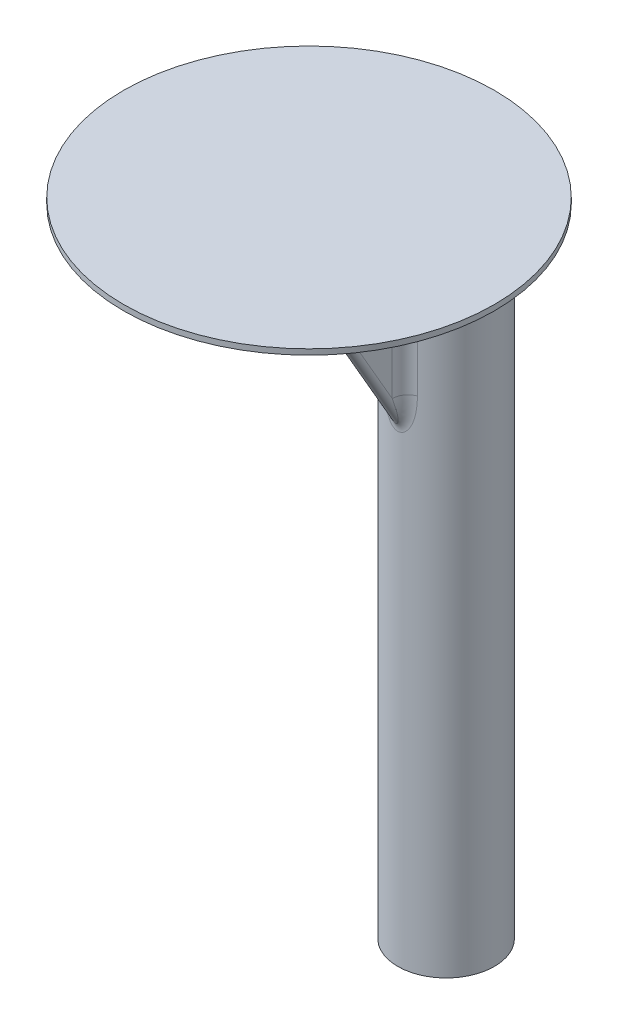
ISO-10303-21;
HEADER;
FILE_DESCRIPTION(('STEP AP214'),'2;1');
FILE_NAME('part.step','',(''),(''),'','','');
FILE_SCHEMA(('AUTOMOTIVE_DESIGN { 1 0 10303 214 1 1 1 1 }'));
ENDSEC;
DATA;
#1=APPLICATION_CONTEXT('core data for automotive mechanical design processes');
#2=APPLICATION_PROTOCOL_DEFINITION('international standard','automotive_design',2000,#1);
#3=PRODUCT_CONTEXT('',#1,'mechanical');
#4=PRODUCT('Part','Part','',(#3));
#5=PRODUCT_RELATED_PRODUCT_CATEGORY('part','',(#4));
#6=PRODUCT_DEFINITION_FORMATION('','',#4);
#7=PRODUCT_DEFINITION_CONTEXT('part definition',#1,'design');
#8=PRODUCT_DEFINITION('design','',#6,#7);
#9=PRODUCT_DEFINITION_SHAPE('','',#8);
#10=(LENGTH_UNIT() NAMED_UNIT(*) SI_UNIT(.MILLI.,.METRE.));
#11=(NAMED_UNIT(*) PLANE_ANGLE_UNIT() SI_UNIT($,.RADIAN.));
#12=(NAMED_UNIT(*) SI_UNIT($,.STERADIAN.) SOLID_ANGLE_UNIT());
#13=UNCERTAINTY_MEASURE_WITH_UNIT(LENGTH_MEASURE(1.E-05),#10,'distance_accuracy_value','');
#14=(GEOMETRIC_REPRESENTATION_CONTEXT(3) GLOBAL_UNCERTAINTY_ASSIGNED_CONTEXT((#13)) GLOBAL_UNIT_ASSIGNED_CONTEXT((#10,
#11,#12)) REPRESENTATION_CONTEXT('',''));
#15=CARTESIAN_POINT('',(0.,0.,0.));
#16=DIRECTION('',(0.,0.,1.));
#17=DIRECTION('',(1.,0.,0.));
#18=AXIS2_PLACEMENT_3D('',#15,#16,#17);
#19=CARTESIAN_POINT('',(0.,90.,0.));
#20=DIRECTION('',(0.,1.,0.));
#21=DIRECTION('',(1.,0.,0.));
#22=AXIS2_PLACEMENT_3D('',#19,#20,#21);
#23=PLANE('',#22);
#24=CARTESIAN_POINT('',(0.,90.,17.37));
#25=DIRECTION('',(0.,1.,0.));
#26=DIRECTION('',(1.,0.,0.));
#27=AXIS2_PLACEMENT_3D('',#24,#25,#26);
#28=CIRCLE('',#27,23.495);
#29=CARTESIAN_POINT('',(0.,90.,-6.125));
#30=VERTEX_POINT('',#29);
#31=CARTESIAN_POINT('',(-23.495,90.,17.37));
#32=VERTEX_POINT('',#31);
#33=EDGE_CURVE('E30',#30,#32,#28,.T.);
#34=ORIENTED_EDGE('',*,*,#33,.T.);
#35=CARTESIAN_POINT('',(0.,90.,17.37));
#36=DIRECTION('',(0.,1.,0.));
#37=DIRECTION('',(1.,0.,0.));
#38=AXIS2_PLACEMENT_3D('',#35,#36,#37);
#39=CIRCLE('',#38,23.495);
#40=EDGE_CURVE('E11',#32,#30,#39,.T.);
#41=ORIENTED_EDGE('',*,*,#40,.T.);
#42=EDGE_LOOP('',(#34,#41));
#43=FACE_BOUND('',#42,.T.);
#44=ADVANCED_FACE('F16',(#43),#23,.T.);
#45=CARTESIAN_POINT('',(0.,90.,17.37));
#46=DIRECTION('',(0.,-1.,0.));
#47=DIRECTION('',(1.,0.,0.));
#48=AXIS2_PLACEMENT_3D('',#45,#46,#47);
#49=CYLINDRICAL_SURFACE('',#48,23.495);
#50=CARTESIAN_POINT('',(0.,89.3,17.37));
#51=DIRECTION('',(0.,-1.,0.));
#52=DIRECTION('',(1.,0.,0.));
#53=AXIS2_PLACEMENT_3D('',#50,#51,#52);
#54=CIRCLE('',#53,23.495);
#55=CARTESIAN_POINT('',(6.15439934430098,89.3,-5.30462003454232));
#56=VERTEX_POINT('',#55);
#57=CARTESIAN_POINT('',(-23.495,89.3,17.37));
#58=VERTEX_POINT('',#57);
#59=EDGE_CURVE('E549',#56,#58,#54,.T.);
#60=ORIENTED_EDGE('',*,*,#59,.F.);
#61=CARTESIAN_POINT('',(6.15439934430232,89.3,-5.30462003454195));
#62=CARTESIAN_POINT('',(6.0846363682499,89.2999997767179,-5.32355575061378));
#63=CARTESIAN_POINT('',(6.01478995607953,89.2987785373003,-5.34216749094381));
#64=CARTESIAN_POINT('',(5.87376433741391,89.2939748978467,-5.37905090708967));
#65=CARTESIAN_POINT('',(5.80258342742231,89.2903510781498,-5.39731072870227));
#66=CARTESIAN_POINT('',(5.65888767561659,89.2807436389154,-5.433456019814));
#67=CARTESIAN_POINT('',(5.58637239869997,89.2747178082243,-5.45132841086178));
#68=CARTESIAN_POINT('',(5.4400046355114,89.2603067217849,-5.48666532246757));
#69=CARTESIAN_POINT('',(5.36615294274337,89.2518787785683,-5.50411562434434));
#70=CARTESIAN_POINT('',(5.21710930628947,89.2326647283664,-5.53857392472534));
#71=CARTESIAN_POINT('',(5.14191936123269,89.2218357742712,-5.55556662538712));
#72=CARTESIAN_POINT('',(4.99020074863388,89.197816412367,-5.5890739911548));
#73=CARTESIAN_POINT('',(4.91367532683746,89.1845831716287,-5.60557233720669));
#74=CARTESIAN_POINT('',(4.67970172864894,89.140918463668,-5.65479807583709));
#75=CARTESIAN_POINT('',(4.52257920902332,89.1071417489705,-5.68616309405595));
#76=CARTESIAN_POINT('',(4.21919854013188,89.0340915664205,-5.74354034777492));
#77=CARTESIAN_POINT('',(4.07286615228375,88.9952834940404,-5.7697630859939));
#78=CARTESIAN_POINT('',(3.77381987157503,88.9095226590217,-5.82046114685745));
#79=CARTESIAN_POINT('',(3.62117031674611,88.8622510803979,-5.84477444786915));
#80=CARTESIAN_POINT('',(3.30948133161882,88.7595867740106,-5.89130789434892));
#81=CARTESIAN_POINT('',(3.15051330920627,88.7039027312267,-5.91335792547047));
#82=CARTESIAN_POINT('',(2.82619254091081,88.5843398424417,-5.95500128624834));
#83=CARTESIAN_POINT('',(2.66091624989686,88.5201909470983,-5.97441750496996));
#84=CARTESIAN_POINT('',(2.49645931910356,88.4536253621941,-5.99199297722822));
#85=B_SPLINE_CURVE_WITH_KNOTS('',3,(#61,#62,#63,#64,#65,#66,#67,#68,#69,#70,#71,#72,#73,#74,#75,
#76,#77,#78,#79,#80,#81,#82,#83,#84),.UNSPECIFIED.,.F.,.F.,(4,2,2,2,2,2,2,2,2,2,2,4),(0.,
0.216844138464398,0.437527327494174,0.662272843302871,0.891292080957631,1.12478482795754,
1.36293961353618,1.85388890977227,2.314665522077,2.79942822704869,3.30892702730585,
3.84380787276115),.UNSPECIFIED.);
#86=CARTESIAN_POINT('',(2.49645931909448,88.4536253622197,-5.99199297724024));
#87=VERTEX_POINT('',#86);
#88=EDGE_CURVE('E591',#56,#87,#85,.T.);
#89=ORIENTED_EDGE('',*,*,#88,.T.);
#90=CARTESIAN_POINT('',(2.20914905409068,88.3346137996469,-6.02091031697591));
#91=CARTESIAN_POINT('',(2.30482501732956,88.3751008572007,-6.01187422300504));
#92=CARTESIAN_POINT('',(2.40061465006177,88.4148124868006,-6.0022349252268));
#93=CARTESIAN_POINT('',(2.49645931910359,88.4536253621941,-5.99199297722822));
#94=(BOUNDED_CURVE() B_SPLINE_CURVE(3,(#90,#91,#92,#93),.UNSPECIFIED.,.F.,
.F.) B_SPLINE_CURVE_WITH_KNOTS((4,4),(0.242848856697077,0.274305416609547),
.UNSPECIFIED.) CURVE() GEOMETRIC_REPRESENTATION_ITEM() RATIONAL_B_SPLINE_CURVE((1.,1.,1.,1.)) REPRESENTATION_ITEM(''));
#95=CARTESIAN_POINT('',(2.20914905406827,88.3346137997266,-6.02091031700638));
#96=VERTEX_POINT('',#95);
#97=EDGE_CURVE('E259',#96,#87,#94,.T.);
#98=ORIENTED_EDGE('',*,*,#97,.F.);
#99=CARTESIAN_POINT('',(0.499971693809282,89.3,-6.11967971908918));
#100=CARTESIAN_POINT('',(0.519838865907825,89.300000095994,-6.11925685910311));
#101=CARTESIAN_POINT('',(0.539705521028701,89.2997038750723,-6.11880958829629));
#102=CARTESIAN_POINT('',(0.579657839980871,89.2985124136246,-6.11786129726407));
#103=CARTESIAN_POINT('',(0.599743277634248,89.2976100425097,-6.1173596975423));
#104=CARTESIAN_POINT('',(0.640109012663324,89.2951858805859,-6.11630188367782));
#105=CARTESIAN_POINT('',(0.660388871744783,89.2936570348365,-6.11574510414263));
#106=CARTESIAN_POINT('',(0.701117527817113,89.2899607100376,-6.11457621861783));
#107=CARTESIAN_POINT('',(0.721565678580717,89.2877862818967,-6.11396356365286));
#108=CARTESIAN_POINT('',(0.762603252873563,89.2827807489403,-6.11268236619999));
#109=CARTESIAN_POINT('',(0.783191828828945,89.2799428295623,-6.11201329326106));
#110=CARTESIAN_POINT('',(0.824480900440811,89.2735936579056,-6.110618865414));
#111=CARTESIAN_POINT('',(0.845180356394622,89.2700757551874,-6.10989300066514));
#112=CARTESIAN_POINT('',(0.886660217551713,89.2623515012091,-6.10838477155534));
#113=CARTESIAN_POINT('',(0.907439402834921,89.25813869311,-6.10760191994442));
#114=CARTESIAN_POINT('',(0.94904622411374,89.2490112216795,-6.10597968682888));
#115=CARTESIAN_POINT('',(0.969872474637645,89.2440903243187,-6.10513984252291));
#116=CARTESIAN_POINT('',(1.01153950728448,89.2335351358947,-6.10340379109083));
#117=CARTESIAN_POINT('',(1.03237875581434,89.2278948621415,-6.10250714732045));
#118=CARTESIAN_POINT('',(1.07403657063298,89.2158914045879,-6.10065786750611));
#119=CARTESIAN_POINT('',(1.0948534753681,89.2095225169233,-6.09970482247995));
#120=CARTESIAN_POINT('',(1.13643023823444,89.196054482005,-6.09774332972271));
#121=CARTESIAN_POINT('',(1.15718832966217,89.1889499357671,-6.09673450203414));
#122=CARTESIAN_POINT('',(1.19861011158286,89.1740055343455,-6.0946622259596));
#123=CARTESIAN_POINT('',(1.21927195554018,89.166160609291,-6.09359842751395));
#124=CARTESIAN_POINT('',(1.26046307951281,89.1497328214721,-6.0914173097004));
#125=CARTESIAN_POINT('',(1.28099046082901,89.1411452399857,-6.09029967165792));
#126=CARTESIAN_POINT('',(1.3218738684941,89.1232320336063,-6.08801183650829));
#127=CARTESIAN_POINT('',(1.34222797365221,89.1139020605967,-6.08684135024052));
#128=CARTESIAN_POINT('',(1.38272566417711,89.0945065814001,-6.08445036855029));
#129=CARTESIAN_POINT('',(1.40286733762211,89.0844371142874,-6.08322962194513));
#130=CARTESIAN_POINT('',(1.44290066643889,89.0635678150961,-6.08073575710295));
#131=CARTESIAN_POINT('',(1.46279045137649,89.0527644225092,-6.07946239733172));
#132=CARTESIAN_POINT('',(1.50014147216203,89.0316450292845,-6.07702036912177));
#133=CARTESIAN_POINT('',(1.51764027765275,89.0213950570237,-6.0758545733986));
#134=CARTESIAN_POINT('',(1.55247786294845,89.0002683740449,-6.07350529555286));
#135=CARTESIAN_POINT('',(1.56981364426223,88.9893867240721,-6.07232174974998));
#136=CARTESIAN_POINT('',(1.60429266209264,88.9669966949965,-6.06993656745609));
#137=CARTESIAN_POINT('',(1.62143285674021,88.9554836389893,-6.06873486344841));
#138=CARTESIAN_POINT('',(1.65548809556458,88.9318327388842,-6.06631771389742));
#139=CARTESIAN_POINT('',(1.67240008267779,88.919690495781,-6.06510223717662));
#140=CARTESIAN_POINT('',(1.70596586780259,88.8947853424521,-6.06266075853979));
#141=CARTESIAN_POINT('',(1.72261661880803,88.882018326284,-6.06143474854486));
#142=CARTESIAN_POINT('',(1.75562676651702,88.855869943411,-6.05897586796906));
#143=CARTESIAN_POINT('',(1.77198315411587,88.8424847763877,-6.05774301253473));
#144=CARTESIAN_POINT('',(1.80437142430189,88.8151086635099,-6.05527410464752));
#145=CARTESIAN_POINT('',(1.82040036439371,88.8011142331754,-6.05403808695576));
#146=CARTESIAN_POINT('',(1.85210079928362,88.7725304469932,-6.05156661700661));
#147=CARTESIAN_POINT('',(1.86776944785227,88.7579379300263,-6.05033121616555));
#148=CARTESIAN_POINT('',(1.89871675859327,88.7281711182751,-6.04786479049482));
#149=CARTESIAN_POINT('',(1.91399270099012,88.712993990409,-6.04663383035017));
#150=CARTESIAN_POINT('',(1.94412265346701,88.6820733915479,-6.0441801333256));
#151=CARTESIAN_POINT('',(1.95897410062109,88.6663274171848,-6.04295747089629));
#152=CARTESIAN_POINT('',(1.98822390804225,88.634286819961,-6.04052422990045));
#153=CARTESIAN_POINT('',(2.00261989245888,88.6179900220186,-6.03931373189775));
#154=CARTESIAN_POINT('',(2.0309286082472,88.5848676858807,-6.03690867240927));
#155=CARTESIAN_POINT('',(2.04483918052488,88.5680402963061,-6.03571419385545));
#156=CARTESIAN_POINT('',(2.07214808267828,88.5338788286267,-6.03334499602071));
#157=CARTESIAN_POINT('',(2.08554449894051,88.5165432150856,-6.03217035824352));
#158=CARTESIAN_POINT('',(2.11179747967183,88.4813894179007,-6.0298446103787));
#159=CARTESIAN_POINT('',(2.12465240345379,88.463570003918,-6.02869357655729));
#160=CARTESIAN_POINT('',(2.14979628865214,88.4274746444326,-6.02641873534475));
#161=CARTESIAN_POINT('',(2.16208390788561,88.4091977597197,-6.02529499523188));
#162=CARTESIAN_POINT('',(2.18606896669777,88.3722154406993,-6.02307832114));
#163=CARTESIAN_POINT('',(2.19776538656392,88.3535093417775,-6.02198544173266));
#164=CARTESIAN_POINT('',(2.20914905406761,88.3346137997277,-6.02091031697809));
#165=B_SPLINE_CURVE_WITH_KNOTS('',3,(#99,#100,#101,#102,#103,#104,#105,#106,#107,#108,#109,#110,
#111,#112,#113,#114,#115,#116,#117,#118,#119,#120,#121,#122,#123,#124,#125,#126,#127,#128,#129,
#130,#131,#132,#133,#134,#135,#136,#137,#138,#139,#140,#141,#142,#143,#144,#145,#146,#147,#148,
#149,#150,#151,#152,#153,#154,#155,#156,#157,#158,#159,#160,#161,#162,#163,#164),.UNSPECIFIED.,
.F.,.F.,(4,2,2,2,2,2,2,2,2,2,2,2,2,2,2,2,2,2,2,2,2,2,2,2,2,2,2,2,2,2,2,2,4),(0.,
0.059612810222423,0.119939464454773,0.180965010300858,0.242672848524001,0.305044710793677,
0.368060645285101,0.431699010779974,0.495936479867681,0.56074805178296,0.626107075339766,
0.691985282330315,0.758352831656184,0.825178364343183,0.892429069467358,0.960070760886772,
1.0280679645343,1.08899857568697,1.15049543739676,1.21253408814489,1.2750885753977,
1.33813149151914,1.40163401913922,1.4655659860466,1.52989592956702,1.59459117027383,
1.65961789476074,1.72494124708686,1.79052542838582,1.85633380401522,1.92232901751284,
1.98847311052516,2.05472764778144),.UNSPECIFIED.);
#166=CARTESIAN_POINT('',(0.499971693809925,89.3,-6.11967971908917));
#167=VERTEX_POINT('',#166);
#168=EDGE_CURVE('E697',#167,#96,#165,.T.);
#169=ORIENTED_EDGE('',*,*,#168,.F.);
#170=CARTESIAN_POINT('',(0.,89.3,17.37));
#171=DIRECTION('',(0.,-1.,0.));
#172=DIRECTION('',(1.,0.,0.));
#173=AXIS2_PLACEMENT_3D('',#170,#171,#172);
#174=CIRCLE('',#173,23.495);
#175=CARTESIAN_POINT('',(-0.499971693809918,89.3,-6.11967971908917));
#176=VERTEX_POINT('',#175);
#177=EDGE_CURVE('E592',#176,#167,#174,.T.);
#178=ORIENTED_EDGE('',*,*,#177,.F.);
#179=CARTESIAN_POINT('',(-2.20914905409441,88.3346137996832,-6.02091031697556));
#180=CARTESIAN_POINT('',(-2.18965614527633,88.3669702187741,-6.02275163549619));
#181=CARTESIAN_POINT('',(-2.1692500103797,88.3987653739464,-6.02465953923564));
#182=CARTESIAN_POINT('',(-2.13698680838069,88.4460325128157,-6.02763182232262));
#183=CARTESIAN_POINT('',(-2.1257771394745,88.4619503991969,-6.02865709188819));
#184=CARTESIAN_POINT('',(-2.10267240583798,88.4937607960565,-6.0307527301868));
#185=CARTESIAN_POINT('',(-2.09076819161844,88.5096466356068,-6.03182358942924));
#186=CARTESIAN_POINT('',(-2.06626159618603,88.5413531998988,-6.03400779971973));
#187=CARTESIAN_POINT('',(-2.05365025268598,88.5571669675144,-6.03512157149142));
#188=CARTESIAN_POINT('',(-2.02771875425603,88.5886880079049,-6.03738866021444));
#189=CARTESIAN_POINT('',(-2.01438986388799,88.6043880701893,-6.03854232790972));
#190=CARTESIAN_POINT('',(-1.98701535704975,88.6356384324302,-6.04088592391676));
#191=CARTESIAN_POINT('',(-1.97296127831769,88.6511812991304,-6.04207613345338));
#192=CARTESIAN_POINT('',(-1.94413136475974,88.6820724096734,-6.04448918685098));
#193=CARTESIAN_POINT('',(-1.92934738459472,88.6974130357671,-6.04571224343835));
#194=CARTESIAN_POINT('',(-1.89905578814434,88.7278534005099,-6.04818702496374));
#195=CARTESIAN_POINT('',(-1.88354038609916,88.7429453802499,-6.04943889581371));
#196=CARTESIAN_POINT('',(-1.85178743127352,88.7728410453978,-6.05196700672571));
#197=CARTESIAN_POINT('',(-1.83554249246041,88.7876368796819,-6.05324332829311));
#198=CARTESIAN_POINT('',(-1.80233551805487,88.8168919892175,-6.05581571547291));
#199=CARTESIAN_POINT('',(-1.78536653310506,88.8313433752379,-6.0571118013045));
#200=CARTESIAN_POINT('',(-1.75072026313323,88.8598607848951,-6.0597187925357));
#201=CARTESIAN_POINT('',(-1.73303649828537,88.8739189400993,-6.06102966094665));
#202=CARTESIAN_POINT('',(-1.69697335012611,88.9016008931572,-6.06366096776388));
#203=CARTESIAN_POINT('',(-1.67858798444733,88.9152169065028,-6.06498131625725));
#204=CARTESIAN_POINT('',(-1.64113830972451,88.9419657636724,-6.06762620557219));
#205=CARTESIAN_POINT('',(-1.62206853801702,88.9550909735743,-6.06895061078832));
#206=CARTESIAN_POINT('',(-1.58327077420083,88.9808099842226,-6.0715974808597));
#207=CARTESIAN_POINT('',(-1.56353785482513,88.9933963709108,-6.07291976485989));
#208=CARTESIAN_POINT('',(-1.5234386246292,89.0179904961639,-6.07555802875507));
#209=CARTESIAN_POINT('',(-1.50306793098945,89.0299911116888,-6.07687381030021));
#210=CARTESIAN_POINT('',(-1.46278644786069,89.0527659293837,-6.07941978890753));
#211=CARTESIAN_POINT('',(-1.4428929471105,89.0635705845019,-6.08065124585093));
#212=CARTESIAN_POINT('',(-1.40285280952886,89.0844421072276,-6.08307202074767));
#213=CARTESIAN_POINT('',(-1.38270804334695,89.0945125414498,-6.08426152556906));
#214=CARTESIAN_POINT('',(-1.342204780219,89.1139096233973,-6.08659750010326));
#215=CARTESIAN_POINT('',(-1.32184819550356,89.1232402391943,-6.08774417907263));
#216=CARTESIAN_POINT('',(-1.28096040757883,89.1411544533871,-6.08999188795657));
#217=CARTESIAN_POINT('',(-1.26043112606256,89.1497424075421,-6.09109316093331));
#218=CARTESIAN_POINT('',(-1.21923675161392,89.1661706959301,-6.09324815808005));
#219=CARTESIAN_POINT('',(-1.1985735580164,89.1740157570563,-6.09430215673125));
#220=CARTESIAN_POINT('',(-1.15714959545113,89.1889602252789,-6.09636077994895));
#221=CARTESIAN_POINT('',(-1.13639067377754,89.1960647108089,-6.09736571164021));
#222=CARTESIAN_POINT('',(-1.09481273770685,89.2095324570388,-6.09932462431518));
#223=CARTESIAN_POINT('',(-1.07399549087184,89.2159011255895,-6.1002789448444));
#224=CARTESIAN_POINT('',(-1.03233744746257,89.2279040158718,-6.10213526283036));
#225=CARTESIAN_POINT('',(-1.01149831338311,89.2335439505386,-6.10303763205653));
#226=CARTESIAN_POINT('',(-0.969831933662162,89.2440983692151,-6.10478889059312));
#227=CARTESIAN_POINT('',(-0.949006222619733,89.2490188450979,-6.10563818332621));
#228=CARTESIAN_POINT('',(-0.907400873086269,89.2581454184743,-6.10728234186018));
#229=CARTESIAN_POINT('',(-0.886622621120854,89.2623577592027,-6.10807764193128));
#230=CARTESIAN_POINT('',(-0.845144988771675,89.2700810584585,-6.10961307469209));
#231=CARTESIAN_POINT('',(-0.824446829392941,89.2735984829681,-6.11035367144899));
#232=CARTESIAN_POINT('',(-0.783160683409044,89.279946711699,-6.11177915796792));
#233=CARTESIAN_POINT('',(-0.762573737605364,89.2827841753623,-6.11246454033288));
#234=CARTESIAN_POINT('',(-0.721539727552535,89.2877888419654,-6.11377925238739));
#235=CARTESIAN_POINT('',(-0.701093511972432,89.2899628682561,-6.11440910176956));
#236=CARTESIAN_POINT('',(-0.660369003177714,89.2936584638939,-6.11561258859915));
#237=CARTESIAN_POINT('',(-0.640091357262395,89.2951869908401,-6.11618677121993));
#238=CARTESIAN_POINT('',(-0.599730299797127,89.2976106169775,-6.11727894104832));
#239=CARTESIAN_POINT('',(-0.579647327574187,89.2985127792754,-6.11779749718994));
#240=CARTESIAN_POINT('',(-0.539700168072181,89.2997039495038,-6.11877860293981));
#241=CARTESIAN_POINT('',(-0.519836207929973,89.3000000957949,-6.11924174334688));
#242=CARTESIAN_POINT('',(-0.499971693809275,89.3,-6.11967971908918));
#243=B_SPLINE_CURVE_WITH_KNOTS('',3,(#179,#180,#181,#182,#183,#184,#185,#186,#187,#188,#189,
#190,#191,#192,#193,#194,#195,#196,#197,#198,#199,#200,#201,#202,#203,#204,#205,#206,#207,#208,
#209,#210,#211,#212,#213,#214,#215,#216,#217,#218,#219,#220,#221,#222,#223,#224,#225,#226,#227,
#228,#229,#230,#231,#232,#233,#234,#235,#236,#237,#238,#239,#240,#241,#242),.UNSPECIFIED.,.F.,
.F.,(4,2,2,2,2,2,2,2,2,2,2,2,2,2,2,2,2,2,2,2,2,2,2,2,2,2,2,2,2,2,2,4),(0.,0.113428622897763,
0.171908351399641,0.231539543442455,0.292302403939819,0.354174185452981,0.417129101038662,
0.481138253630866,0.546169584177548,0.612187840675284,0.679154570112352,0.747028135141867,
0.815763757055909,0.885313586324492,0.955626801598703,1.02664973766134,1.09465196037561,
1.16229814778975,1.22955275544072,1.29638153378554,1.36275161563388,1.42863159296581,
1.49399158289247,1.55880328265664,1.62304001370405,1.68667675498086,1.7496901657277,
1.81205859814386,1.87376210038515,1.93478241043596,1.99510294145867,2.05470875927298),.UNSPECIFIED.);
#244=CARTESIAN_POINT('',(-2.20914905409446,88.3346137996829,-6.02091031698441));
#245=VERTEX_POINT('',#244);
#246=EDGE_CURVE('E762',#176,#245,#243,.F.);
#247=ORIENTED_EDGE('',*,*,#246,.T.);
#248=CARTESIAN_POINT('',(-2.20914905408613,88.334613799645,-6.02091031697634));
#249=CARTESIAN_POINT('',(-2.30482543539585,88.3751010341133,-6.01187418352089));
#250=CARTESIAN_POINT('',(-2.40061498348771,88.4148126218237,-6.00223488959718));
#251=CARTESIAN_POINT('',(-2.49645931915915,88.4536253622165,-5.99199297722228));
#252=(BOUNDED_CURVE() B_SPLINE_CURVE(3,(#248,#249,#250,#251),.UNSPECIFIED.,.F.,
.F.) B_SPLINE_CURVE_WITH_KNOTS((4,4),(-2.4918326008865,-2.46037604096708),
.UNSPECIFIED.) CURVE() GEOMETRIC_REPRESENTATION_ITEM() RATIONAL_B_SPLINE_CURVE((1.,1.,1.,1.)) REPRESENTATION_ITEM(''));
#253=CARTESIAN_POINT('',(-2.49645931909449,88.4536253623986,-5.99199297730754));
#254=VERTEX_POINT('',#253);
#255=EDGE_CURVE('E458',#245,#254,#252,.T.);
#256=ORIENTED_EDGE('',*,*,#255,.T.);
#257=CARTESIAN_POINT('',(-6.15439934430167,89.3,-5.30462003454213));
#258=CARTESIAN_POINT('',(-6.08404850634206,89.2999981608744,-5.3237160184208));
#259=CARTESIAN_POINT('',(-6.013614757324,89.2987502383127,-5.342488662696));
#260=CARTESIAN_POINT('',(-5.87135902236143,89.2938503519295,-5.37970241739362));
#261=CARTESIAN_POINT('',(-5.79953528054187,89.290154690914,-5.39813112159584));
#262=CARTESIAN_POINT('',(-5.65461797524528,89.2803724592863,-5.43458284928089));
#263=CARTESIAN_POINT('',(-5.58152400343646,89.2742455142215,-5.45259328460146));
#264=CARTESIAN_POINT('',(-5.43417754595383,89.2596203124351,-5.48814527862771));
#265=CARTESIAN_POINT('',(-5.3599257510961,89.2510847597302,-5.50567427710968));
#266=CARTESIAN_POINT('',(-5.21036916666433,89.2316714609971,-5.5402079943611));
#267=CARTESIAN_POINT('',(-5.13506598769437,89.220759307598,-5.55720029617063));
#268=CARTESIAN_POINT('',(-4.98350771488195,89.1966316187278,-5.59061421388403));
#269=CARTESIAN_POINT('',(-4.90725503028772,89.1833843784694,-5.60702365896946));
#270=CARTESIAN_POINT('',(-4.67562518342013,89.1399597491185,-5.65566593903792));
#271=CARTESIAN_POINT('',(-4.52057146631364,89.1065216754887,-5.68657485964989));
#272=CARTESIAN_POINT('',(-4.21700131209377,89.0334720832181,-5.74402070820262));
#273=CARTESIAN_POINT('',(-4.06844437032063,88.9941143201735,-5.7706719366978));
#274=CARTESIAN_POINT('',(-3.76615786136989,88.9074393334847,-5.82190042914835));
#275=CARTESIAN_POINT('',(-3.61248241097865,88.8598515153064,-5.8463381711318));
#276=CARTESIAN_POINT('',(-3.30044236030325,88.7568687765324,-5.89276567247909));
#277=CARTESIAN_POINT('',(-3.14213603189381,88.7012377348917,-5.91461843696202));
#278=CARTESIAN_POINT('',(-2.82107331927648,88.5825083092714,-5.95564725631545));
#279=CARTESIAN_POINT('',(-2.65837468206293,88.5192072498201,-5.97469104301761));
#280=CARTESIAN_POINT('',(-2.49645931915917,88.4536253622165,-5.99199297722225));
#281=B_SPLINE_CURVE_WITH_KNOTS('',3,(#257,#258,#259,#260,#261,#262,#263,#264,#265,#266,#267,
#268,#269,#270,#271,#272,#273,#274,#275,#276,#277,#278,#279,#280),.UNSPECIFIED.,.F.,.F.,(4,2,2,
2,2,2,2,2,2,2,2,4),(0.,0.218671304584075,0.441355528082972,0.667903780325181,0.898173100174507,
1.132028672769,1.36934589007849,1.85388436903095,2.32165075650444,2.80964485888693,
3.31715597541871,3.84383511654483),.UNSPECIFIED.);
#282=CARTESIAN_POINT('',(-6.15439934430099,89.3,-5.30462003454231));
#283=VERTEX_POINT('',#282);
#284=EDGE_CURVE('E466',#283,#254,#281,.T.);
#285=ORIENTED_EDGE('',*,*,#284,.F.);
#286=CARTESIAN_POINT('',(0.,89.3,17.37));
#287=DIRECTION('',(0.,-1.,0.));
#288=DIRECTION('',(1.,0.,0.));
#289=AXIS2_PLACEMENT_3D('',#286,#287,#288);
#290=CIRCLE('',#289,23.495);
#291=EDGE_CURVE('E558',#58,#283,#290,.T.);
#292=ORIENTED_EDGE('',*,*,#291,.F.);
#293=DIRECTION('',(0.,1.,0.));
#294=VECTOR('',#293,1.);
#295=CARTESIAN_POINT('',(-23.495,90.,17.37));
#296=LINE('',#295,#294);
#297=EDGE_CURVE('E242',#58,#32,#296,.T.);
#298=ORIENTED_EDGE('',*,*,#297,.T.);
#299=ORIENTED_EDGE('',*,*,#33,.F.);
#300=ORIENTED_EDGE('',*,*,#40,.F.);
#301=ORIENTED_EDGE('',*,*,#297,.F.);
#302=EDGE_LOOP('',(#60,#89,#98,#169,#178,#247,#256,#285,#292,#298,#299,#300,#301));
#303=FACE_BOUND('',#302,.T.);
#304=ADVANCED_FACE('F368',(#303),#49,.T.);
#305=CARTESIAN_POINT('',(0.,79.5368217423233,16.9103207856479));
#306=DIRECTION('',(0.,-0.866025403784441,-0.5));
#307=DIRECTION('',(0.70710678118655,-0.353553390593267,0.612372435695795));
#308=AXIS2_PLACEMENT_3D('',#305,#306,#307);
#309=CYLINDRICAL_SURFACE('',#308,0.8);
#310=CARTESIAN_POINT('',(0.8,63.4581489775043,7.6272947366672));
#311=CARTESIAN_POINT('',(0.800000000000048,62.9796715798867,7.44713230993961));
#312=CARTESIAN_POINT('',(0.77366606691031,62.0333188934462,7.10251122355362));
#313=CARTESIAN_POINT('',(0.625950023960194,60.7100603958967,6.66589489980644));
#314=CARTESIAN_POINT('',(0.333936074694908,59.8689566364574,6.43099627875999));
#315=CARTESIAN_POINT('',(-0.000503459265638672,59.6706961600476,6.38032339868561));
#316=CARTESIAN_POINT('',(-0.186777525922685,59.7816504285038,6.40878320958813));
#317=CARTESIAN_POINT('',(-0.334179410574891,59.9809123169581,6.46274019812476));
#318=CARTESIAN_POINT('',(-0.465180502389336,60.2522140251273,6.53817756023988));
#319=CARTESIAN_POINT('',(-0.649006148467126,60.9293014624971,6.7386660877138));
#320=CARTESIAN_POINT('',(-0.77488229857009,62.0331468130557,7.10204645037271));
#321=CARTESIAN_POINT('',(-0.799999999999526,62.9796715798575,7.44713230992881));
#322=CARTESIAN_POINT('',(-0.8,63.4581489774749,7.62729473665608));
#323=(BOUNDED_CURVE() B_SPLINE_CURVE(3,(#310,#311,#312,#313,#314,#315,#316,#317,#318,#319,#320,
#321,#322),.UNSPECIFIED.,.F.,.F.) B_SPLINE_CURVE_WITH_KNOTS((4,1,1,1,1,1,1,1,1,1,4),(0.,
0.174748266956,0.349496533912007,0.524244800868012,0.611618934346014,0.698993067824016,
0.720836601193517,0.786367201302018,0.873741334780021,1.04848960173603,1.22323786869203),
.UNSPECIFIED.) CURVE() GEOMETRIC_REPRESENTATION_ITEM() RATIONAL_B_SPLINE_CURVE((1.,1.,1.,1.,1.,
1.,1.,1.,1.,1.,1.,1.,1.)) REPRESENTATION_ITEM(''));
#324=CARTESIAN_POINT('',(0.8,63.4581489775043,7.62729473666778));
#325=VERTEX_POINT('',#324);
#326=CARTESIAN_POINT('',(-0.8,63.4581489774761,7.62729473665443));
#327=VERTEX_POINT('',#326);
#328=EDGE_CURVE('E791',#325,#327,#323,.T.);
#329=ORIENTED_EDGE('',*,*,#328,.F.);
#330=DIRECTION('',(0.,0.866025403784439,0.5));
#331=VECTOR('',#330,1.);
#332=CARTESIAN_POINT('',(0.8,79.5368217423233,16.9103207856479));
#333=LINE('',#332,#331);
#334=CARTESIAN_POINT('',(0.8,87.3,21.3923938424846));
#335=VERTEX_POINT('',#334);
#336=EDGE_CURVE('E267',#325,#335,#333,.T.);
#337=ORIENTED_EDGE('',*,*,#336,.T.);
#338=CARTESIAN_POINT('',(-0.8,87.3,21.3923938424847));
#339=CARTESIAN_POINT('',(-0.8,87.4495996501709,21.6169594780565));
#340=CARTESIAN_POINT('',(-0.745349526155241,87.748688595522,22.0659250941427));
#341=CARTESIAN_POINT('',(-0.515876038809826,88.108628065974,22.606234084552));
#342=CARTESIAN_POINT('',(-0.184078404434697,88.3082452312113,22.9058815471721));
#343=CARTESIAN_POINT('',(0.184103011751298,88.3083369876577,22.9060192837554));
#344=CARTESIAN_POINT('',(0.515852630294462,88.1085460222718,22.6061109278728));
#345=CARTESIAN_POINT('',(0.745357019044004,87.7487141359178,22.0659634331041));
#346=CARTESIAN_POINT('',(0.8,87.4495996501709,21.6169594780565));
#347=CARTESIAN_POINT('',(0.8,87.3,21.3923938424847));
#348=(BOUNDED_CURVE() B_SPLINE_CURVE(3,(#338,#339,#340,#341,#342,#343,#344,#345,#346,#347),
.UNSPECIFIED.,.F.,.F.) B_SPLINE_CURVE_WITH_KNOTS((4,1,1,1,1,1,1,4),(-1.5707963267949,
-1.12199737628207,-0.673198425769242,-0.224399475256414,0.224399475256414,0.673198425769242,
1.12199737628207,1.5707963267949),
.UNSPECIFIED.) CURVE() GEOMETRIC_REPRESENTATION_ITEM() RATIONAL_B_SPLINE_CURVE((1.,1.,1.,1.,1.,
1.,1.,1.,1.,1.)) REPRESENTATION_ITEM(''));
#349=CARTESIAN_POINT('',(-0.8,87.3,21.3923938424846));
#350=VERTEX_POINT('',#349);
#351=EDGE_CURVE('E404',#350,#335,#348,.T.);
#352=ORIENTED_EDGE('',*,*,#351,.F.);
#353=DIRECTION('',(0.,-0.866025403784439,-0.5));
#354=VECTOR('',#353,1.);
#355=CARTESIAN_POINT('',(-0.8,79.5368217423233,16.9103207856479));
#356=LINE('',#355,#354);
#357=EDGE_CURVE('E210',#350,#327,#356,.T.);
#358=ORIENTED_EDGE('',*,*,#357,.T.);
#359=EDGE_LOOP('',(#329,#337,#352,#358));
#360=FACE_BOUND('',#359,.T.);
#361=ADVANCED_FACE('F369',(#360),#309,.T.);
#362=CARTESIAN_POINT('',(0.,0.,0.));
#363=DIRECTION('',(0.,1.,0.));
#364=DIRECTION('',(0.,0.,1.));
#365=AXIS2_PLACEMENT_3D('',#362,#363,#364);
#366=CYLINDRICAL_SURFACE('',#365,6.125);
#367=DIRECTION('',(0.,1.,0.));
#368=VECTOR('',#367,1.);
#369=CARTESIAN_POINT('',(2.11076923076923,0.,5.74980680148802));
#370=LINE('',#369,#368);
#371=CARTESIAN_POINT('',(2.11076923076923,63.4581489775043,5.74980680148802));
#372=VERTEX_POINT('',#371);
#373=CARTESIAN_POINT('',(2.11076923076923,72.8,5.74980680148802));
#374=VERTEX_POINT('',#373);
#375=EDGE_CURVE('E274',#372,#374,#370,.T.);
#376=ORIENTED_EDGE('',*,*,#375,.F.);
#377=CARTESIAN_POINT('',(-2.1107692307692,63.4581489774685,5.7498068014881));
#378=CARTESIAN_POINT('',(-2.11076923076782,62.8756547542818,5.74980680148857));
#379=CARTESIAN_POINT('',(-2.04449714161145,61.7111184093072,5.7743228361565));
#380=CARTESIAN_POINT('',(-1.71237776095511,60.3107404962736,5.88757246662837));
#381=CARTESIAN_POINT('',(-1.22736086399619,59.4275086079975,6.00559773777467));
#382=CARTESIAN_POINT('',(-0.881719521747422,59.0683066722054,6.06350088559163));
#383=CARTESIAN_POINT('',(-0.492805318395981,58.8029162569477,6.10916962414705));
#384=CARTESIAN_POINT('',(-0.00132835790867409,58.6534242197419,6.13803406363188));
#385=CARTESIAN_POINT('',(0.881077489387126,58.9207424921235,6.08606486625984));
#386=CARTESIAN_POINT('',(1.65154506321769,60.0332508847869,5.90876930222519));
#387=CARTESIAN_POINT('',(2.04128816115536,61.7108949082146,5.77518971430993));
#388=CARTESIAN_POINT('',(2.11076923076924,62.8756547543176,5.74980680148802));
#389=CARTESIAN_POINT('',(2.11076923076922,63.4581489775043,5.74980680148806));
#390=(BOUNDED_CURVE() B_SPLINE_CURVE(3,(#377,#378,#379,#380,#381,#382,#383,#384,#385,#386,#387,
#388,#389),.UNSPECIFIED.,.F.,.F.) B_SPLINE_CURVE_WITH_KNOTS((4,1,1,1,1,1,1,1,1,1,4),(0.,
0.174748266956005,0.349496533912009,0.436870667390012,0.502401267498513,0.524244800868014,
0.611618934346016,0.698993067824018,0.873741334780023,1.04848960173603,1.22323786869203),
.UNSPECIFIED.) CURVE() GEOMETRIC_REPRESENTATION_ITEM() RATIONAL_B_SPLINE_CURVE((1.,1.,1.,1.,1.,
1.,1.,1.,1.,1.,1.,1.,1.)) REPRESENTATION_ITEM(''));
#391=CARTESIAN_POINT('',(-2.11076923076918,63.4581489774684,5.74980680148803));
#392=VERTEX_POINT('',#391);
#393=EDGE_CURVE('E268',#392,#372,#390,.T.);
#394=ORIENTED_EDGE('',*,*,#393,.F.);
#395=DIRECTION('',(0.,-1.,0.));
#396=VECTOR('',#395,1.);
#397=CARTESIAN_POINT('',(-2.11076923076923,0.,5.74980680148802));
#398=LINE('',#397,#396);
#399=CARTESIAN_POINT('',(-2.11076923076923,72.8,5.74980680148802));
#400=VERTEX_POINT('',#399);
#401=EDGE_CURVE('E720',#400,#392,#398,.T.);
#402=ORIENTED_EDGE('',*,*,#401,.F.);
#403=CARTESIAN_POINT('',(0.,72.8,0.));
#404=DIRECTION('',(0.,-1.,0.));
#405=DIRECTION('',(1.,0.,0.));
#406=AXIS2_PLACEMENT_3D('',#403,#404,#405);
#407=CIRCLE('',#406,6.125);
#408=EDGE_CURVE('E228',#374,#400,#407,.T.);
#409=ORIENTED_EDGE('',*,*,#408,.F.);
#410=EDGE_LOOP('',(#376,#394,#402,#409));
#411=FACE_BOUND('',#410,.T.);
#412=CARTESIAN_POINT('',(0.,76.8,0.));
#413=DIRECTION('',(0.,-1.,0.));
#414=DIRECTION('',(1.,0.,0.));
#415=AXIS2_PLACEMENT_3D('',#412,#413,#414);
#416=CIRCLE('',#415,6.125);
#417=CARTESIAN_POINT('',(2.11076923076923,76.8,5.74980680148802));
#418=VERTEX_POINT('',#417);
#419=CARTESIAN_POINT('',(-2.11076923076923,76.8,5.74980680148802));
#420=VERTEX_POINT('',#419);
#421=EDGE_CURVE('E248',#418,#420,#416,.T.);
#422=ORIENTED_EDGE('',*,*,#421,.T.);
#423=DIRECTION('',(0.,-1.,0.));
#424=VECTOR('',#423,1.);
#425=CARTESIAN_POINT('',(-2.11076923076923,0.,5.74980680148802));
#426=LINE('',#425,#424);
#427=CARTESIAN_POINT('',(-2.11076923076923,87.3,5.74980680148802));
#428=VERTEX_POINT('',#427);
#429=EDGE_CURVE('E264',#428,#420,#426,.T.);
#430=ORIENTED_EDGE('',*,*,#429,.F.);
#431=CARTESIAN_POINT('',(0.,87.3,0.));
#432=DIRECTION('',(0.,1.,0.));
#433=DIRECTION('',(-0.999492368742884,0.,-0.0318591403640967));
#434=AXIS2_PLACEMENT_3D('',#431,#432,#433);
#435=CIRCLE('',#434,6.125);
#436=CARTESIAN_POINT('',(-2.44738468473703,87.3,-5.61479591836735));
#437=VERTEX_POINT('',#436);
#438=EDGE_CURVE('E492',#437,#428,#435,.T.);
#439=ORIENTED_EDGE('',*,*,#438,.F.);
#440=DIRECTION('',(0.,-1.,0.));
#441=VECTOR('',#440,1.);
#442=CARTESIAN_POINT('',(-2.44738468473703,89.3,-5.61479591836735));
#443=LINE('',#442,#441);
#444=CARTESIAN_POINT('',(-2.44738468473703,0.,-5.61479591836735));
#445=VERTEX_POINT('',#444);
#446=EDGE_CURVE('E505',#437,#445,#443,.T.);
#447=ORIENTED_EDGE('',*,*,#446,.T.);
#448=CARTESIAN_POINT('',(0.,0.,0.));
#449=DIRECTION('',(0.,1.,0.));
#450=DIRECTION('',(-1.,0.,0.));
#451=AXIS2_PLACEMENT_3D('',#448,#449,#450);
#452=CIRCLE('',#451,6.125);
#453=CARTESIAN_POINT('',(2.44738468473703,0.,-5.61479591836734));
#454=VERTEX_POINT('',#453);
#455=EDGE_CURVE('E278',#445,#454,#452,.T.);
#456=ORIENTED_EDGE('',*,*,#455,.T.);
#457=DIRECTION('',(0.,1.,0.));
#458=VECTOR('',#457,1.);
#459=CARTESIAN_POINT('',(2.44738468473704,89.3,-5.61479591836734));
#460=LINE('',#459,#458);
#461=CARTESIAN_POINT('',(2.44738468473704,87.3,-5.61479591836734));
#462=VERTEX_POINT('',#461);
#463=EDGE_CURVE('E640',#454,#462,#460,.T.);
#464=ORIENTED_EDGE('',*,*,#463,.T.);
#465=CARTESIAN_POINT('',(0.,87.3,0.));
#466=DIRECTION('',(0.,1.,0.));
#467=DIRECTION('',(0.999492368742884,0.,-0.0318591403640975));
#468=AXIS2_PLACEMENT_3D('',#465,#466,#467);
#469=CIRCLE('',#468,6.125);
#470=CARTESIAN_POINT('',(2.11076923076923,87.3,5.74980680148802));
#471=VERTEX_POINT('',#470);
#472=EDGE_CURVE('E570',#471,#462,#469,.T.);
#473=ORIENTED_EDGE('',*,*,#472,.F.);
#474=DIRECTION('',(0.,1.,0.));
#475=VECTOR('',#474,1.);
#476=CARTESIAN_POINT('',(2.11076923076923,0.,5.74980680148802));
#477=LINE('',#476,#475);
#478=EDGE_CURVE('E269',#418,#471,#477,.T.);
#479=ORIENTED_EDGE('',*,*,#478,.F.);
#480=EDGE_LOOP('',(#422,#430,#439,#447,#456,#464,#473,#479));
#481=FACE_BOUND('',#480,.T.);
#482=ADVANCED_FACE('F372',(#411,#481),#366,.T.);
#483=CARTESIAN_POINT('',(0.,0.,0.));
#484=DIRECTION('',(0.,1.,0.));
#485=DIRECTION('',(1.,0.,0.));
#486=AXIS2_PLACEMENT_3D('',#483,#484,#485);
#487=PLANE('',#486);
#488=CARTESIAN_POINT('',(0.,0.,-6.125));
#489=DIRECTION('',(0.,1.,0.));
#490=DIRECTION('',(1.,0.,0.));
#491=AXIS2_PLACEMENT_3D('',#488,#489,#490);
#492=CIRCLE('',#491,2.5);
#493=EDGE_CURVE('E510',#445,#454,#492,.T.);
#494=ORIENTED_EDGE('',*,*,#493,.T.);
#495=ORIENTED_EDGE('',*,*,#455,.F.);
#496=EDGE_LOOP('',(#494,#495));
#497=FACE_BOUND('',#496,.T.);
#498=ADVANCED_FACE('F364',(#497),#487,.F.);
#499=CARTESIAN_POINT('',(0.8,68.9736434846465,11.7354274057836));
#500=DIRECTION('',(1.,0.,0.));
#501=DIRECTION('',(0.,1.,0.));
#502=AXIS2_PLACEMENT_3D('',#499,#500,#501);
#503=PLANE('',#502);
#504=DIRECTION('',(0.,0.,-1.));
#505=VECTOR('',#504,1.);
#506=CARTESIAN_POINT('',(0.8,76.8,5.86771370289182));
#507=LINE('',#506,#505);
#508=CARTESIAN_POINT('',(0.8,76.8,8.5878184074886));
#509=VERTEX_POINT('',#508);
#510=CARTESIAN_POINT('',(0.8,76.8,7.62729473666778));
#511=VERTEX_POINT('',#510);
#512=EDGE_CURVE('E253',#509,#511,#507,.T.);
#513=ORIENTED_EDGE('',*,*,#512,.T.);
#514=DIRECTION('',(0.,-1.,0.));
#515=VECTOR('',#514,1.);
#516=CARTESIAN_POINT('',(0.8,0.,7.62729473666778));
#517=LINE('',#516,#515);
#518=CARTESIAN_POINT('',(0.8,87.3,7.62729473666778));
#519=VERTEX_POINT('',#518);
#520=EDGE_CURVE('E211',#519,#511,#517,.T.);
#521=ORIENTED_EDGE('',*,*,#520,.F.);
#522=DIRECTION('',(0.,0.,-1.));
#523=VECTOR('',#522,1.);
#524=CARTESIAN_POINT('',(0.8,87.3,14.5527137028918));
#525=LINE('',#524,#523);
#526=EDGE_CURVE('E401',#335,#519,#525,.T.);
#527=ORIENTED_EDGE('',*,*,#526,.F.);
#528=ORIENTED_EDGE('',*,*,#336,.F.);
#529=DIRECTION('',(0.,-1.,0.));
#530=VECTOR('',#529,1.);
#531=CARTESIAN_POINT('',(0.8,0.,7.62729473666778));
#532=LINE('',#531,#530);
#533=CARTESIAN_POINT('',(0.8,72.8,7.62729473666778));
#534=VERTEX_POINT('',#533);
#535=EDGE_CURVE('E222',#534,#325,#532,.T.);
#536=ORIENTED_EDGE('',*,*,#535,.F.);
#537=DIRECTION('',(0.,0.,1.));
#538=VECTOR('',#537,1.);
#539=CARTESIAN_POINT('',(0.8,72.8,5.86771370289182));
#540=LINE('',#539,#538);
#541=CARTESIAN_POINT('',(0.8,72.8,8.5878184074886));
#542=VERTEX_POINT('',#541);
#543=EDGE_CURVE('E636',#534,#542,#540,.T.);
#544=ORIENTED_EDGE('',*,*,#543,.T.);
#545=DIRECTION('',(0.,1.,0.));
#546=VECTOR('',#545,1.);
#547=CARTESIAN_POINT('',(0.8,74.8,8.5878184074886));
#548=LINE('',#547,#546);
#549=EDGE_CURVE('E247',#542,#509,#548,.T.);
#550=ORIENTED_EDGE('',*,*,#549,.T.);
#551=EDGE_LOOP('',(#513,#521,#527,#528,#536,#544,#550));
#552=FACE_BOUND('',#551,.T.);
#553=ADVANCED_FACE('F361',(#552),#503,.T.);
#554=CARTESIAN_POINT('',(-2.8,0.,7.62729473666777));
#555=DIRECTION('',(0.,1.,0.));
#556=DIRECTION('',(0.819943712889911,0.,-0.572444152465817));
#557=AXIS2_PLACEMENT_3D('',#554,#555,#556);
#558=CYLINDRICAL_SURFACE('',#557,2.);
#559=CARTESIAN_POINT('',(-2.8,76.8,7.62729473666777));
#560=DIRECTION('',(0.,-1.,0.));
#561=DIRECTION('',(0.819943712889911,0.,-0.572444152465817));
#562=AXIS2_PLACEMENT_3D('',#559,#560,#561);
#563=CIRCLE('',#562,2.);
#564=CARTESIAN_POINT('',(-0.8,76.8,7.62729473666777));
#565=VERTEX_POINT('',#564);
#566=EDGE_CURVE('E263',#420,#565,#563,.T.);
#567=ORIENTED_EDGE('',*,*,#566,.T.);
#568=DIRECTION('',(0.,1.,0.));
#569=VECTOR('',#568,1.);
#570=CARTESIAN_POINT('',(-0.8,0.,7.62729473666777));
#571=LINE('',#570,#569);
#572=CARTESIAN_POINT('',(-0.8,87.3,7.62729473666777));
#573=VERTEX_POINT('',#572);
#574=EDGE_CURVE('E398',#565,#573,#571,.T.);
#575=ORIENTED_EDGE('',*,*,#574,.T.);
#576=CARTESIAN_POINT('',(-2.8,87.3,7.62729473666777));
#577=DIRECTION('',(0.,-1.,0.));
#578=DIRECTION('',(0.819943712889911,0.,-0.572444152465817));
#579=AXIS2_PLACEMENT_3D('',#576,#577,#578);
#580=CIRCLE('',#579,2.);
#581=EDGE_CURVE('E608',#428,#573,#580,.T.);
#582=ORIENTED_EDGE('',*,*,#581,.F.);
#583=ORIENTED_EDGE('',*,*,#429,.T.);
#584=EDGE_LOOP('',(#567,#575,#582,#583));
#585=FACE_BOUND('',#584,.T.);
#586=ADVANCED_FACE('F300',(#585),#558,.F.);
#587=CARTESIAN_POINT('',(-0.8,63.4581489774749,7.62729473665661));
#588=CARTESIAN_POINT('',(-0.799999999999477,62.9796715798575,7.4471323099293));
#589=CARTESIAN_POINT('',(-0.774882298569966,62.0331468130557,7.10204645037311));
#590=CARTESIAN_POINT('',(-0.64900614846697,60.9293014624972,6.73866608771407));
#591=CARTESIAN_POINT('',(-0.465180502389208,60.2522140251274,6.53817756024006));
#592=CARTESIAN_POINT('',(-0.334179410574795,59.9809123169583,6.46274019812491));
#593=CARTESIAN_POINT('',(-0.186777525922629,59.781650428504,6.40878320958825));
#594=CARTESIAN_POINT('',(-0.000503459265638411,59.6706961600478,6.38032339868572));
#595=CARTESIAN_POINT('',(0.333936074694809,59.8689566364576,6.43099627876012));
#596=CARTESIAN_POINT('',(0.625950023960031,60.7100603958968,6.66589489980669));
#597=CARTESIAN_POINT('',(0.773666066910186,62.0333188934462,7.10251122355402));
#598=CARTESIAN_POINT('',(0.8,62.9796715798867,7.4471323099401));
#599=CARTESIAN_POINT('',(0.8,63.4581489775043,7.62729473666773));
#600=CARTESIAN_POINT('',(-0.800000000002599,63.4581489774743,7.16292624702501));
#601=CARTESIAN_POINT('',(-0.842586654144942,62.9709156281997,7.01713548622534));
#602=CARTESIAN_POINT('',(-0.883437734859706,61.9951391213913,6.74997629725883));
#603=CARTESIAN_POINT('',(-0.785483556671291,60.8355514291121,6.4989105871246));
#604=CARTESIAN_POINT('',(-0.576942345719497,60.1162712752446,6.37499267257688));
#605=CARTESIAN_POINT('',(-0.418045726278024,59.8265809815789,6.33168400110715));
#606=CARTESIAN_POINT('',(-0.235460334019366,59.6134039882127,6.3016909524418));
#607=CARTESIAN_POINT('',(-0.000732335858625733,59.4943014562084,6.28693450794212));
#608=CARTESIAN_POINT('',(0.420942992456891,59.7071525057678,6.31309125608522));
#609=CARTESIAN_POINT('',(0.768680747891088,60.605351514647,6.44832713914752));
#610=CARTESIAN_POINT('',(0.881753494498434,61.995243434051,6.75052350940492));
#611=CARTESIAN_POINT('',(0.842586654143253,62.9709156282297,7.01713548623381));
#612=CARTESIAN_POINT('',(0.800000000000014,63.4581489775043,7.16292624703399));
#613=CARTESIAN_POINT('',(-1.09509082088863,63.4581489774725,6.35350845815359));
#614=CARTESIAN_POINT('',(-1.16429861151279,62.9399760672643,6.29307695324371));
#615=CARTESIAN_POINT('',(-1.2374536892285,61.8949671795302,6.19284413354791));
#616=CARTESIAN_POINT('',(-1.10559803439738,60.6361774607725,6.14001614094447));
#617=CARTESIAN_POINT('',(-0.814186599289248,59.8471816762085,6.14303084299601));
#618=CARTESIAN_POINT('',(-0.590141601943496,59.527676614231,6.15173797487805));
#619=CARTESIAN_POINT('',(-0.332495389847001,59.2920602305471,6.16034644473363));
#620=CARTESIAN_POINT('',(-0.00103435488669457,59.1598756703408,6.16750909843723));
#621=CARTESIAN_POINT('',(0.59490242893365,59.3961644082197,6.15445338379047));
#622=CARTESIAN_POINT('',(1.08350519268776,60.3864930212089,6.12867152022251));
#623=CARTESIAN_POINT('',(1.23486138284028,61.8949326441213,6.19343060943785));
#624=CARTESIAN_POINT('',(1.16429861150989,62.9399760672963,6.29307695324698));
#625=CARTESIAN_POINT('',(1.09509082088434,63.4581489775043,6.35350845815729));
#626=CARTESIAN_POINT('',(-1.78382689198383,63.4581489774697,5.86982819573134));
#627=CARTESIAN_POINT('',(-1.80795039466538,62.8949334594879,5.86115014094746));
#628=CARTESIAN_POINT('',(-1.7898559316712,61.766252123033,5.86350697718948));
#629=CARTESIAN_POINT('',(-1.52396953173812,60.4083590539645,5.9404191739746));
#630=CARTESIAN_POINT('',(-1.10016359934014,59.553404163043,6.03058267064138));
#631=CARTESIAN_POINT('',(-0.792248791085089,59.2061132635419,6.07616625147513));
#632=CARTESIAN_POINT('',(-0.443765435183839,58.9496565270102,6.11242254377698));
#633=CARTESIAN_POINT('',(-0.00124760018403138,58.8053573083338,6.13565936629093));
#634=CARTESIAN_POINT('',(0.793548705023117,59.0633656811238,6.09378568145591));
#635=CARTESIAN_POINT('',(1.47600375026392,60.1392130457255,5.95452153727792));
#636=CARTESIAN_POINT('',(1.78681569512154,61.7660847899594,5.86431151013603));
#637=CARTESIAN_POINT('',(1.8079503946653,62.8949334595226,5.86115014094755));
#638=CARTESIAN_POINT('',(1.78382689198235,63.4581489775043,5.86982819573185));
#639=CARTESIAN_POINT('',(-2.1107692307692,63.4581489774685,5.7498068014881));
#640=CARTESIAN_POINT('',(-2.11076923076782,62.8756547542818,5.74980680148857));
#641=CARTESIAN_POINT('',(-2.04449714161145,61.7111184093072,5.7743228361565));
#642=CARTESIAN_POINT('',(-1.71237776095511,60.3107404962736,5.88757246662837));
#643=CARTESIAN_POINT('',(-1.22736086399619,59.4275086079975,6.00559773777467));
#644=CARTESIAN_POINT('',(-0.881719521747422,59.0683066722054,6.06350088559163));
#645=CARTESIAN_POINT('',(-0.492805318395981,58.8029162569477,6.10916962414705));
#646=CARTESIAN_POINT('',(-0.00132835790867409,58.6534242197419,6.13803406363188));
#647=CARTESIAN_POINT('',(0.881077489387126,58.9207424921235,6.08606486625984));
#648=CARTESIAN_POINT('',(1.65154506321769,60.0332508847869,5.90876930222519));
#649=CARTESIAN_POINT('',(2.04128816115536,61.7108949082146,5.77518971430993));
#650=CARTESIAN_POINT('',(2.11076923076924,62.8756547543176,5.74980680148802));
#651=CARTESIAN_POINT('',(2.11076923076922,63.4581489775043,5.74980680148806));
#652=(BOUNDED_SURFACE() B_SPLINE_SURFACE(3,3,((#587,#588,#589,#590,#591,#592,#593,#594,#595,
#596,#597,#598,#599),(#600,#601,#602,#603,#604,#605,#606,#607,#608,#609,#610,#611,#612),(#613,
#614,#615,#616,#617,#618,#619,#620,#621,#622,#623,#624,#625),(#626,#627,#628,#629,#630,#631,
#632,#633,#634,#635,#636,#637,#638),(#639,#640,#641,#642,#643,#644,#645,#646,#647,#648,#649,
#650,#651)),.UNSPECIFIED.,.F.,.F.,.F.) B_SPLINE_SURFACE_WITH_KNOTS((4,1,4),(4,1,1,1,1,1,1,1,1,1,
4),(0.,0.571428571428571,1.),(0.,0.174748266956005,0.349496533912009,0.436870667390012,
0.502401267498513,0.524244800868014,0.611618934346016,0.698993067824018,0.873741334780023,
1.04848960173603,1.22323786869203),
.UNSPECIFIED.) GEOMETRIC_REPRESENTATION_ITEM() RATIONAL_B_SPLINE_SURFACE(((1.,1.,1.,1.,1.,1.,1.,
1.,1.,1.,1.,1.,1.),(1.,1.,1.,1.,1.,1.,1.,1.,1.,1.,1.,1.,1.),(1.,1.,1.,1.,1.,1.,1.,1.,1.,1.,1.,
1.,1.),(1.,1.,1.,1.,1.,1.,1.,1.,1.,1.,1.,1.,1.),(1.,1.,1.,1.,1.,1.,1.,1.,1.,1.,1.,1.,1.))) REPRESENTATION_ITEM('') SURFACE());
#653=CARTESIAN_POINT('',(2.11076923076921,63.4581484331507,5.74980680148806));
#654=CARTESIAN_POINT('',(1.78382691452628,63.4581484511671,5.86982818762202));
#655=CARTESIAN_POINT('',(1.09509088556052,63.4581484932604,6.35350840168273));
#656=CARTESIAN_POINT('',(0.800000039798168,63.4581485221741,7.16292611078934));
#657=CARTESIAN_POINT('',(0.799999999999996,63.4581485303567,7.627294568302));
#658=(BOUNDED_CURVE() B_SPLINE_CURVE(3,(#653,#654,#655,#656,#657),.UNSPECIFIED.,.F.,
.F.) B_SPLINE_CURVE_WITH_KNOTS((4,1,4),(0.,0.428571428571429,1.),
.UNSPECIFIED.) CURVE() GEOMETRIC_REPRESENTATION_ITEM() RATIONAL_B_SPLINE_CURVE((1.,1.,1.,1.,1.)) REPRESENTATION_ITEM(''));
#659=EDGE_CURVE('E341',#325,#372,#658,.F.);
#660=CARTESIAN_POINT('',(-0.799999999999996,63.4581485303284,7.62729456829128));
#661=CARTESIAN_POINT('',(-0.800000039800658,63.4581485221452,7.16292611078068));
#662=CARTESIAN_POINT('',(-1.09509088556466,63.4581484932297,6.35350840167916));
#663=CARTESIAN_POINT('',(-1.78382691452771,63.4581484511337,5.86982818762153));
#664=CARTESIAN_POINT('',(-2.11076923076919,63.4581484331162,5.7498068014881));
#665=(BOUNDED_CURVE() B_SPLINE_CURVE(3,(#660,#661,#662,#663,#664),.UNSPECIFIED.,.F.,
.F.) B_SPLINE_CURVE_WITH_KNOTS((4,1,4),(0.,0.571428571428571,1.),
.UNSPECIFIED.) CURVE() GEOMETRIC_REPRESENTATION_ITEM() RATIONAL_B_SPLINE_CURVE((1.,1.,1.,1.,1.)) REPRESENTATION_ITEM(''));
#666=EDGE_CURVE('E204',#327,#392,#665,.T.);
#667=ORIENTED_EDGE('',*,*,#659,.F.);
#668=ORIENTED_EDGE('',*,*,#328,.T.);
#669=ORIENTED_EDGE('',*,*,#666,.T.);
#670=ORIENTED_EDGE('',*,*,#393,.T.);
#671=EDGE_LOOP('',(#667,#668,#669,#670));
#672=FACE_BOUND('',#671,.T.);
#673=ADVANCED_FACE('F287',(#672),#652,.T.);
#674=CARTESIAN_POINT('',(0.8,87.3,21.3923938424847));
#675=CARTESIAN_POINT('',(0.8,87.4495996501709,21.6169594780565));
#676=CARTESIAN_POINT('',(0.745357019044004,87.7487141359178,22.0659634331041));
#677=CARTESIAN_POINT('',(0.515852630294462,88.1085460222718,22.6061109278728));
#678=CARTESIAN_POINT('',(0.184103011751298,88.3083369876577,22.9060192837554));
#679=CARTESIAN_POINT('',(-0.184078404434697,88.3082452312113,22.9058815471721));
#680=CARTESIAN_POINT('',(-0.515876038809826,88.108628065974,22.606234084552));
#681=CARTESIAN_POINT('',(-0.745349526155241,87.748688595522,22.0659250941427));
#682=CARTESIAN_POINT('',(-0.8,87.4495996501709,21.6169594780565));
#683=CARTESIAN_POINT('',(-0.8,87.3,21.3923938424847));
#684=CARTESIAN_POINT('',(0.8,87.8983986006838,21.3923938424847));
#685=CARTESIAN_POINT('',(0.846152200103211,88.0193546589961,21.6161168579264));
#686=CARTESIAN_POINT('',(0.865360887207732,88.2510911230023,22.1013047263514));
#687=CARTESIAN_POINT('',(0.65099317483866,88.511523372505,22.7382607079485));
#688=CARTESIAN_POINT('',(0.239954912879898,88.6507754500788,23.1083751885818));
#689=CARTESIAN_POINT('',(-0.240386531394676,88.650836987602,23.1081596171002));
#690=CARTESIAN_POINT('',(-0.650448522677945,88.5116732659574,22.7385137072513));
#691=CARTESIAN_POINT('',(-0.865504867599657,88.2510926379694,22.1012401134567));
#692=CARTESIAN_POINT('',(-0.846152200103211,88.0193546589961,21.6161168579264));
#693=CARTESIAN_POINT('',(-0.8,87.8983986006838,21.3923938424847));
#694=CARTESIAN_POINT('',(1.30206326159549,88.9344454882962,21.3923938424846));
#695=CARTESIAN_POINT('',(1.37325515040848,88.9708734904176,21.6822335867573));
#696=CARTESIAN_POINT('',(1.39912932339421,89.0370157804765,22.3181254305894));
#697=CARTESIAN_POINT('',(1.04046217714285,89.1070306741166,23.1598175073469));
#698=CARTESIAN_POINT('',(0.383737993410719,89.1427760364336,23.648305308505));
#699=CARTESIAN_POINT('',(-0.383493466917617,89.1427351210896,23.6479773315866));
#700=CARTESIAN_POINT('',(-1.04073438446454,89.1069904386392,23.1600743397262));
#701=CARTESIAN_POINT('',(-1.39905114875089,89.0370102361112,22.3180369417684));
#702=CARTESIAN_POINT('',(-1.37325515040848,88.9708734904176,21.6822335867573));
#703=CARTESIAN_POINT('',(-1.30206326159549,88.9344454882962,21.3923938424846));
#704=CARTESIAN_POINT('',(2.35120104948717,89.3,21.3923938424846));
#705=CARTESIAN_POINT('',(2.37234391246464,89.2996210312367,21.8180732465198));
#706=CARTESIAN_POINT('',(2.24611463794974,89.2997727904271,22.6858511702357));
#707=CARTESIAN_POINT('',(1.57589491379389,89.2994867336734,23.7527118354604));
#708=CARTESIAN_POINT('',(0.566229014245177,89.2996871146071,24.3513613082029));
#709=CARTESIAN_POINT('',(-0.566047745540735,89.2997545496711,24.3510522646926));
#710=CARTESIAN_POINT('',(-1.57609065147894,89.2995691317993,23.7529698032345));
#711=CARTESIAN_POINT('',(-2.24605724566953,89.2997806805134,22.685766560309));
#712=CARTESIAN_POINT('',(-2.37234391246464,89.2996210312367,21.8180732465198));
#713=CARTESIAN_POINT('',(-2.35120104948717,89.3,21.3923938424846));
#714=CARTESIAN_POINT('',(2.8,89.3,21.3923938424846));
#715=CARTESIAN_POINT('',(2.8,89.3,21.8760736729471));
#716=CARTESIAN_POINT('',(2.60874956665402,89.3,22.8431591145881));
#717=CARTESIAN_POINT('',(1.80548420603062,89.3,24.0065537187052));
#718=CARTESIAN_POINT('',(0.644360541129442,89.3,24.6525101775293));
#719=CARTESIAN_POINT('',(-0.644274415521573,89.3,24.6522135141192));
#720=CARTESIAN_POINT('',(-1.80556613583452,89.3,24.0068189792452));
#721=CARTESIAN_POINT('',(-2.60872334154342,89.3,22.8430765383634));
#722=CARTESIAN_POINT('',(-2.8,89.3,21.8760736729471));
#723=CARTESIAN_POINT('',(-2.8,89.3,21.3923938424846));
#724=(BOUNDED_SURFACE() B_SPLINE_SURFACE(3,3,((#674,#675,#676,#677,#678,#679,#680,#681,#682,
#683),(#684,#685,#686,#687,#688,#689,#690,#691,#692,#693),(#694,#695,#696,#697,#698,#699,#700,
#701,#702,#703),(#704,#705,#706,#707,#708,#709,#710,#711,#712,#713),(#714,#715,#716,#717,#718,
#719,#720,#721,#722,#723)),.UNSPECIFIED.,.F.,.F.,.F.) B_SPLINE_SURFACE_WITH_KNOTS((4,1,4),(4,1,
1,1,1,1,1,4),(0.,0.571428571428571,1.),(-1.5707963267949,-1.12199737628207,-0.673198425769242,
-0.224399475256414,0.224399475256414,0.673198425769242,1.12199737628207,1.5707963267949),
.UNSPECIFIED.) GEOMETRIC_REPRESENTATION_ITEM() RATIONAL_B_SPLINE_SURFACE(((1.,1.,1.,1.,1.,1.,1.,
1.,1.,1.),(1.,1.,1.,1.,1.,1.,1.,1.,1.,1.),(1.,1.,1.,1.,1.,1.,1.,1.,1.,1.),(1.,1.,1.,1.,1.,1.,1.,
1.,1.,1.),(1.,1.,1.,1.,1.,1.,1.,1.,1.,1.))) REPRESENTATION_ITEM('') SURFACE());
#725=CARTESIAN_POINT('',(0.799999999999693,87.3000008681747,21.3923951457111));
#726=CARTESIAN_POINT('',(0.80000026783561,87.8983993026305,21.3923951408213));
#727=CARTESIAN_POINT('',(1.3020636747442,88.9344456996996,21.3923955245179));
#728=CARTESIAN_POINT('',(2.35120117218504,89.2999999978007,21.3923963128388));
#729=CARTESIAN_POINT('',(2.79999999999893,89.3,21.3923966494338));
#730=(BOUNDED_CURVE() B_SPLINE_CURVE(3,(#725,#726,#727,#728,#729),.UNSPECIFIED.,.F.,
.F.) B_SPLINE_CURVE_WITH_KNOTS((4,1,4),(0.,0.571428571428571,1.),
.UNSPECIFIED.) CURVE() GEOMETRIC_REPRESENTATION_ITEM() RATIONAL_B_SPLINE_CURVE((1.,1.,1.,1.,1.)) REPRESENTATION_ITEM(''));
#731=CARTESIAN_POINT('',(2.8,89.3,21.3923938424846));
#732=VERTEX_POINT('',#731);
#733=EDGE_CURVE('E258',#335,#732,#730,.T.);
#734=CARTESIAN_POINT('',(0.,89.3,21.3923938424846));
#735=DIRECTION('',(0.,-1.,0.));
#736=DIRECTION('',(0.,0.,1.));
#737=AXIS2_PLACEMENT_3D('',#734,#735,#736);
#738=ELLIPSE('',#737,3.2331615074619,2.8);
#739=CARTESIAN_POINT('',(-2.8,89.3,21.3923938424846));
#740=VERTEX_POINT('',#739);
#741=EDGE_CURVE('E457',#732,#740,#738,.T.);
#742=CARTESIAN_POINT('',(-2.79999999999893,89.3,21.3923966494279));
#743=CARTESIAN_POINT('',(-2.35120117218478,89.2999999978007,21.3923963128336));
#744=CARTESIAN_POINT('',(-1.30206367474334,88.9344456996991,21.3923955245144));
#745=CARTESIAN_POINT('',(-0.80000026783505,87.8983993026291,21.3923951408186));
#746=CARTESIAN_POINT('',(-0.799999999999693,87.3000008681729,21.3923951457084));
#747=(BOUNDED_CURVE() B_SPLINE_CURVE(3,(#742,#743,#744,#745,#746),.UNSPECIFIED.,.F.,
.F.) B_SPLINE_CURVE_WITH_KNOTS((4,1,4),(0.,0.428571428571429,1.),
.UNSPECIFIED.) CURVE() GEOMETRIC_REPRESENTATION_ITEM() RATIONAL_B_SPLINE_CURVE((1.,1.,1.,1.,1.)) REPRESENTATION_ITEM(''));
#748=EDGE_CURVE('E579',#350,#740,#747,.F.);
#749=CARTESIAN_POINT('',(0.8,87.3,21.3923938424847));
#750=CARTESIAN_POINT('',(0.8,87.4495996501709,21.6169594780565));
#751=CARTESIAN_POINT('',(0.745357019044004,87.7487141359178,22.0659634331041));
#752=CARTESIAN_POINT('',(0.515852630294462,88.1085460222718,22.6061109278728));
#753=CARTESIAN_POINT('',(0.184103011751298,88.3083369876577,22.9060192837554));
#754=CARTESIAN_POINT('',(-0.184078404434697,88.3082452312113,22.9058815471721));
#755=CARTESIAN_POINT('',(-0.515876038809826,88.108628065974,22.606234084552));
#756=CARTESIAN_POINT('',(-0.745349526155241,87.748688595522,22.0659250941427));
#757=CARTESIAN_POINT('',(-0.8,87.4495996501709,21.6169594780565));
#758=CARTESIAN_POINT('',(-0.8,87.3,21.3923938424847));
#759=CARTESIAN_POINT('',(0.8,87.8983986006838,21.3923938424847));
#760=CARTESIAN_POINT('',(0.846152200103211,88.0193546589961,21.6161168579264));
#761=CARTESIAN_POINT('',(0.865360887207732,88.2510911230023,22.1013047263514));
#762=CARTESIAN_POINT('',(0.65099317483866,88.511523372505,22.7382607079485));
#763=CARTESIAN_POINT('',(0.239954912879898,88.6507754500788,23.1083751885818));
#764=CARTESIAN_POINT('',(-0.240386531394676,88.650836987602,23.1081596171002));
#765=CARTESIAN_POINT('',(-0.650448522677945,88.5116732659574,22.7385137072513));
#766=CARTESIAN_POINT('',(-0.865504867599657,88.2510926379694,22.1012401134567));
#767=CARTESIAN_POINT('',(-0.846152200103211,88.0193546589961,21.6161168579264));
#768=CARTESIAN_POINT('',(-0.8,87.8983986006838,21.3923938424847));
#769=CARTESIAN_POINT('',(1.30206326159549,88.9344454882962,21.3923938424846));
#770=CARTESIAN_POINT('',(1.37325515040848,88.9708734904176,21.6822335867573));
#771=CARTESIAN_POINT('',(1.39912932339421,89.0370157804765,22.3181254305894));
#772=CARTESIAN_POINT('',(1.04046217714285,89.1070306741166,23.1598175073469));
#773=CARTESIAN_POINT('',(0.383737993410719,89.1427760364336,23.648305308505));
#774=CARTESIAN_POINT('',(-0.383493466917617,89.1427351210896,23.6479773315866));
#775=CARTESIAN_POINT('',(-1.04073438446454,89.1069904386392,23.1600743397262));
#776=CARTESIAN_POINT('',(-1.39905114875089,89.0370102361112,22.3180369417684));
#777=CARTESIAN_POINT('',(-1.37325515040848,88.9708734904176,21.6822335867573));
#778=CARTESIAN_POINT('',(-1.30206326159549,88.9344454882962,21.3923938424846));
#779=CARTESIAN_POINT('',(2.35120104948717,89.3,21.3923938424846));
#780=CARTESIAN_POINT('',(2.37234391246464,89.2996210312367,21.8180732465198));
#781=CARTESIAN_POINT('',(2.24611463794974,89.2997727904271,22.6858511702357));
#782=CARTESIAN_POINT('',(1.57589491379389,89.2994867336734,23.7527118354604));
#783=CARTESIAN_POINT('',(0.566229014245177,89.2996871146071,24.3513613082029));
#784=CARTESIAN_POINT('',(-0.566047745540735,89.2997545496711,24.3510522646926));
#785=CARTESIAN_POINT('',(-1.57609065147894,89.2995691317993,23.7529698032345));
#786=CARTESIAN_POINT('',(-2.24605724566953,89.2997806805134,22.685766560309));
#787=CARTESIAN_POINT('',(-2.37234391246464,89.2996210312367,21.8180732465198));
#788=CARTESIAN_POINT('',(-2.35120104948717,89.3,21.3923938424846));
#789=CARTESIAN_POINT('',(2.8,89.3,21.3923938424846));
#790=CARTESIAN_POINT('',(2.8,89.3,21.8760736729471));
#791=CARTESIAN_POINT('',(2.60874956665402,89.3,22.8431591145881));
#792=CARTESIAN_POINT('',(1.80548420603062,89.3,24.0065537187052));
#793=CARTESIAN_POINT('',(0.644360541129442,89.3,24.6525101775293));
#794=CARTESIAN_POINT('',(-0.644274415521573,89.3,24.6522135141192));
#795=CARTESIAN_POINT('',(-1.80556613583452,89.3,24.0068189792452));
#796=CARTESIAN_POINT('',(-2.60872334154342,89.3,22.8430765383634));
#797=CARTESIAN_POINT('',(-2.8,89.3,21.8760736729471));
#798=CARTESIAN_POINT('',(-2.8,89.3,21.3923938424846));
#799=CARTESIAN_POINT('',(2.80012566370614,89.3,21.3923938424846));
#800=CARTESIAN_POINT('',(2.80011974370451,89.3000001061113,21.8760899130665));
#801=CARTESIAN_POINT('',(2.60885110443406,89.3000000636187,22.8432031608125));
#802=CARTESIAN_POINT('',(1.80554849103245,89.3000001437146,24.0066247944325));
#803=CARTESIAN_POINT('',(0.64438241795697,89.3000000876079,24.6525944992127));
#804=CARTESIAN_POINT('',(-0.644296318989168,89.3000000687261,24.652297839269));
#805=CARTESIAN_POINT('',(-1.80563038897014,89.3000001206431,24.0068900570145));
#806=CARTESIAN_POINT('',(-2.60882488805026,89.3000000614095,22.8431205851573));
#807=CARTESIAN_POINT('',(-2.80011974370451,89.3000001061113,21.8760899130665));
#808=CARTESIAN_POINT('',(-2.80012566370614,89.3,21.3923938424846));
#809=CARTESIAN_POINT('',(2.80025132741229,89.3,21.3923938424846));
#810=CARTESIAN_POINT('',(2.80023948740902,89.3000002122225,21.8761061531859));
#811=CARTESIAN_POINT('',(2.60895264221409,89.3000001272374,22.8432472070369));
#812=CARTESIAN_POINT('',(1.80561277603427,89.3000002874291,24.0066958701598));
#813=CARTESIAN_POINT('',(0.644404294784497,89.3000001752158,24.6526788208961));
#814=CARTESIAN_POINT('',(-0.644318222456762,89.3000001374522,24.6523821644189));
#815=CARTESIAN_POINT('',(-1.80569464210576,89.3000002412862,24.0069611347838));
#816=CARTESIAN_POINT('',(-2.60892643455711,89.3000001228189,22.8431646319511));
#817=CARTESIAN_POINT('',(-2.80023948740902,89.3000002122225,21.8761061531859));
#818=CARTESIAN_POINT('',(-2.80025132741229,89.3,21.3923938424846));
#819=CARTESIAN_POINT('',(2.80037699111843,89.3,21.3923938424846));
#820=CARTESIAN_POINT('',(2.80035923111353,89.3000003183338,21.8761223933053));
#821=CARTESIAN_POINT('',(2.60905417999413,89.300000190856,22.8432912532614));
#822=CARTESIAN_POINT('',(1.8056770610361,89.3000004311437,24.0067669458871));
#823=CARTESIAN_POINT('',(0.644426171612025,89.3000002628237,24.6527631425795));
#824=CARTESIAN_POINT('',(-0.644340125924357,89.3000002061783,24.6524664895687));
#825=CARTESIAN_POINT('',(-1.80575889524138,89.3000003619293,24.007032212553));
#826=CARTESIAN_POINT('',(-2.60902798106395,89.3000001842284,22.843208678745));
#827=CARTESIAN_POINT('',(-2.80035923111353,89.3000003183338,21.8761223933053));
#828=CARTESIAN_POINT('',(-2.80037699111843,89.3,21.3923938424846));
#829=(BOUNDED_SURFACE() B_SPLINE_SURFACE(3,3,((#749,#750,#751,#752,#753,#754,#755,#756,#757,
#758),(#759,#760,#761,#762,#763,#764,#765,#766,#767,#768),(#769,#770,#771,#772,#773,#774,#775,
#776,#777,#778),(#779,#780,#781,#782,#783,#784,#785,#786,#787,#788),(#789,#790,#791,#792,#793,
#794,#795,#796,#797,#798),(#799,#800,#801,#802,#803,#804,#805,#806,#807,#808),(#809,#810,#811,
#812,#813,#814,#815,#816,#817,#818),(#819,#820,#821,#822,#823,#824,#825,#826,#827,#828)),
.UNSPECIFIED.,.F.,.F.,.F.) B_SPLINE_SURFACE_WITH_KNOTS((4,1,3,4),(4,1,1,1,1,1,1,4),(0.,
0.571428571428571,1.,1.00012),(-1.5707963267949,-1.12199737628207,-0.673198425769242,
-0.224399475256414,0.224399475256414,0.673198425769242,1.12199737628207,1.5707963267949),
.UNSPECIFIED.) GEOMETRIC_REPRESENTATION_ITEM() RATIONAL_B_SPLINE_SURFACE(((1.,1.,1.,1.,1.,1.,1.,
1.,1.,1.),(1.,1.,1.,1.,1.,1.,1.,1.,1.,1.),(1.,1.,1.,1.,1.,1.,1.,1.,1.,1.),(1.,1.,1.,1.,1.,1.,1.,
1.,1.,1.),(1.,1.,1.,1.,1.,1.,1.,1.,1.,1.),(1.,1.,1.,1.,1.,1.,1.,1.,1.,1.),(1.,1.,1.,1.,1.,1.,1.,
1.,1.,1.),(1.,1.,1.,1.,1.,1.,1.,1.,1.,1.))) REPRESENTATION_ITEM('') SURFACE());
#830=ORIENTED_EDGE('',*,*,#733,.T.);
#831=ORIENTED_EDGE('',*,*,#741,.T.);
#832=ORIENTED_EDGE('',*,*,#748,.F.);
#833=ORIENTED_EDGE('',*,*,#351,.T.);
#834=EDGE_LOOP('',(#830,#831,#832,#833));
#835=FACE_BOUND('',#834,.T.);
#836=ADVANCED_FACE('F299',(#835),#829,.T.);
#837=CARTESIAN_POINT('',(2.8,87.3,14.5527137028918));
#838=DIRECTION('',(0.,0.,-1.));
#839=DIRECTION('',(-0.707106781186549,0.707106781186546,0.));
#840=AXIS2_PLACEMENT_3D('',#837,#838,#839);
#841=CYLINDRICAL_SURFACE('',#840,2.);
#842=CARTESIAN_POINT('',(2.8,87.3,7.62729473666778));
#843=DIRECTION('',(0.,0.,1.));
#844=DIRECTION('',(-0.707106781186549,0.707106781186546,0.));
#845=AXIS2_PLACEMENT_3D('',#842,#843,#844);
#846=CIRCLE('',#845,2.);
#847=CARTESIAN_POINT('',(2.8,89.3,7.62729473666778));
#848=VERTEX_POINT('',#847);
#849=EDGE_CURVE('E254',#848,#519,#846,.T.);
#850=ORIENTED_EDGE('',*,*,#849,.F.);
#851=DIRECTION('',(0.,0.,1.));
#852=VECTOR('',#851,1.);
#853=CARTESIAN_POINT('',(2.8,89.3,14.5527137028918));
#854=LINE('',#853,#852);
#855=EDGE_CURVE('E565',#848,#732,#854,.T.);
#856=ORIENTED_EDGE('',*,*,#855,.T.);
#857=ORIENTED_EDGE('',*,*,#733,.F.);
#858=ORIENTED_EDGE('',*,*,#526,.T.);
#859=EDGE_LOOP('',(#850,#856,#857,#858));
#860=FACE_BOUND('',#859,.T.);
#861=ADVANCED_FACE('F428',(#860),#841,.F.);
#862=CARTESIAN_POINT('',(2.8,87.3,7.62729473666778));
#863=DIRECTION('',(0.,0.,1.));
#864=DIRECTION('',(1.,0.,0.));
#865=AXIS2_PLACEMENT_3D('',#862,#863,#864);
#866=SPHERICAL_SURFACE('',#865,2.);
#867=CARTESIAN_POINT('',(2.8,87.3,7.62729473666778));
#868=DIRECTION('',(-0.93874396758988,0.,0.344615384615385));
#869=DIRECTION('',(0.,1.,0.));
#870=AXIS2_PLACEMENT_3D('',#867,#868,#869);
#871=CIRCLE('',#870,2.);
#872=EDGE_CURVE('E621',#848,#471,#871,.T.);
#873=ORIENTED_EDGE('',*,*,#872,.F.);
#874=ORIENTED_EDGE('',*,*,#849,.T.);
#875=CARTESIAN_POINT('',(2.8,87.3,7.62729473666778));
#876=DIRECTION('',(0.,-1.,0.));
#877=DIRECTION('',(-0.819943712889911,0.,-0.572444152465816));
#878=AXIS2_PLACEMENT_3D('',#875,#876,#877);
#879=CIRCLE('',#878,2.);
#880=EDGE_CURVE('E273',#519,#471,#879,.T.);
#881=ORIENTED_EDGE('',*,*,#880,.T.);
#882=EDGE_LOOP('',(#873,#874,#881));
#883=FACE_BOUND('',#882,.T.);
#884=ADVANCED_FACE('F540',(#883),#866,.F.);
#885=CARTESIAN_POINT('',(0.,87.3,0.));
#886=DIRECTION('',(0.,-1.,0.));
#887=DIRECTION('',(0.,0.,-1.));
#888=AXIS2_PLACEMENT_3D('',#885,#886,#887);
#889=TOROIDAL_SURFACE('',#888,8.125,2.);
#890=ORIENTED_EDGE('',*,*,#88,.F.);
#891=CARTESIAN_POINT('',(0.,89.3,0.));
#892=DIRECTION('',(0.,-1.,0.));
#893=DIRECTION('',(0.999492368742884,0.,-0.0318591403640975));
#894=AXIS2_PLACEMENT_3D('',#891,#892,#893);
#895=CIRCLE('',#894,8.125);
#896=EDGE_CURVE('E559',#56,#848,#895,.T.);
#897=ORIENTED_EDGE('',*,*,#896,.T.);
#898=ORIENTED_EDGE('',*,*,#872,.T.);
#899=ORIENTED_EDGE('',*,*,#472,.T.);
#900=CARTESIAN_POINT('',(2.20914905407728,88.3346137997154,-6.02091031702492));
#901=CARTESIAN_POINT('',(2.21889065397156,88.3173736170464,-6.00623528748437));
#902=CARTESIAN_POINT('',(2.22835355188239,88.2997947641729,-5.99177055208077));
#903=CARTESIAN_POINT('',(2.24672206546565,88.2639493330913,-5.96331869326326));
#904=CARTESIAN_POINT('',(2.25562729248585,88.2456822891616,-5.94933190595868));
#905=CARTESIAN_POINT('',(2.27286780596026,88.2084724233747,-5.921912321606));
#906=CARTESIAN_POINT('',(2.28120304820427,88.1895295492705,-5.90847956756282));
#907=CARTESIAN_POINT('',(2.29729218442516,88.150985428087,-5.88224385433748));
#908=CARTESIAN_POINT('',(2.30504632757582,88.1313844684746,-5.86944062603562));
#909=CARTESIAN_POINT('',(2.31996318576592,88.0915458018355,-5.84453786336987));
#910=CARTESIAN_POINT('',(2.32712638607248,88.0713086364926,-5.83243775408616));
#911=CARTESIAN_POINT('',(2.34085236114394,88.0302238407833,-5.80901269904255));
#912=CARTESIAN_POINT('',(2.34741579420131,88.0093769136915,-5.79768690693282));
#913=CARTESIAN_POINT('',(2.35993415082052,87.9671034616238,-5.77587875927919));
#914=CARTESIAN_POINT('',(2.36588983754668,87.9456777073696,-5.76539534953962));
#915=CARTESIAN_POINT('',(2.37718537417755,87.9022819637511,-5.74533643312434));
#916=CARTESIAN_POINT('',(2.38252601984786,87.8803127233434,-5.73575975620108));
#917=CARTESIAN_POINT('',(2.39252807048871,87.8361198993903,-5.71767629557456));
#918=CARTESIAN_POINT('',(2.39719711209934,87.81390289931,-5.7091576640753));
#919=CARTESIAN_POINT('',(2.40591155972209,87.7690710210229,-5.6931463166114));
#920=CARTESIAN_POINT('',(2.40995906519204,87.7464577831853,-5.6856501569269));
#921=CARTESIAN_POINT('',(2.41743111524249,87.700879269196,-5.67173076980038));
#922=CARTESIAN_POINT('',(2.42085753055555,87.6779152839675,-5.66530432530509));
#923=CARTESIAN_POINT('',(2.42708793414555,87.6316838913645,-5.65356478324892));
#924=CARTESIAN_POINT('',(2.42989348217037,87.6084174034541,-5.64824889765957));
#925=CARTESIAN_POINT('',(2.43488234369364,87.5616320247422,-5.63876408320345));
#926=CARTESIAN_POINT('',(2.43706683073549,87.5381136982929,-5.63459299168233));
#927=CARTESIAN_POINT('',(2.4408132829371,87.4908776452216,-5.62742392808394));
#928=CARTESIAN_POINT('',(2.44237597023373,87.4671601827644,-5.62442459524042));
#929=CARTESIAN_POINT('',(2.44487779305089,87.4195802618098,-5.61961860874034));
#930=CARTESIAN_POINT('',(2.44581714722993,87.3957178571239,-5.6178115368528));
#931=CARTESIAN_POINT('',(2.44707087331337,87.3479037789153,-5.61539881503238));
#932=CARTESIAN_POINT('',(2.44738492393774,87.3239520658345,-5.61479378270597));
#933=CARTESIAN_POINT('',(2.44738468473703,87.3,-5.61479591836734));
#934=B_SPLINE_CURVE_WITH_KNOTS('',3,(#900,#901,#902,#903,#904,#905,#906,#907,#908,#909,#910,
#911,#912,#913,#914,#915,#916,#917,#918,#919,#920,#921,#922,#923,#924,#925,#926,#927,#928,#929,
#930,#931,#932,#933),.UNSPECIFIED.,.F.,.F.,(4,2,2,2,2,2,2,2,2,2,2,2,2,2,2,2,4),(0.,
0.0739387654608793,0.147928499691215,0.221923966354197,0.295887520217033,0.369789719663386,
0.443609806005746,0.517336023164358,0.59096575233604,0.663677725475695,0.73613841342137,
0.808377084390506,0.880432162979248,0.952350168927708,1.02418440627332,1.09599343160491,
1.16783934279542),.UNSPECIFIED.);
#935=EDGE_CURVE('E518',#462,#96,#934,.F.);
#936=ORIENTED_EDGE('',*,*,#935,.T.);
#937=ORIENTED_EDGE('',*,*,#97,.T.);
#938=EDGE_LOOP('',(#890,#897,#898,#899,#936,#937));
#939=FACE_BOUND('',#938,.T.);
#940=ADVANCED_FACE('F531',(#939),#889,.F.);
#941=CARTESIAN_POINT('',(-2.8,87.3,14.5527137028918));
#942=DIRECTION('',(0.,0.,1.));
#943=DIRECTION('',(0.707106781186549,0.707106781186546,0.));
#944=AXIS2_PLACEMENT_3D('',#941,#942,#943);
#945=CYLINDRICAL_SURFACE('',#944,2.);
#946=CARTESIAN_POINT('',(-2.8,87.3,7.62729473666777));
#947=DIRECTION('',(0.,0.,1.));
#948=DIRECTION('',(0.707106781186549,0.707106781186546,0.));
#949=AXIS2_PLACEMENT_3D('',#946,#947,#948);
#950=CIRCLE('',#949,2.);
#951=CARTESIAN_POINT('',(-2.8,89.3,7.62729473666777));
#952=VERTEX_POINT('',#951);
#953=EDGE_CURVE('E502',#573,#952,#950,.T.);
#954=ORIENTED_EDGE('',*,*,#953,.F.);
#955=DIRECTION('',(0.,0.,1.));
#956=VECTOR('',#955,1.);
#957=CARTESIAN_POINT('',(-0.8,87.3,14.5527137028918));
#958=LINE('',#957,#956);
#959=EDGE_CURVE('E389',#573,#350,#958,.T.);
#960=ORIENTED_EDGE('',*,*,#959,.T.);
#961=ORIENTED_EDGE('',*,*,#748,.T.);
#962=DIRECTION('',(0.,0.,-1.));
#963=VECTOR('',#962,1.);
#964=CARTESIAN_POINT('',(-2.8,89.3,14.5527137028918));
#965=LINE('',#964,#963);
#966=EDGE_CURVE('E448',#740,#952,#965,.T.);
#967=ORIENTED_EDGE('',*,*,#966,.T.);
#968=EDGE_LOOP('',(#954,#960,#961,#967));
#969=FACE_BOUND('',#968,.T.);
#970=ADVANCED_FACE('F18',(#969),#945,.F.);
#971=CARTESIAN_POINT('',(0.,89.3,17.37));
#972=DIRECTION('',(0.,1.,0.));
#973=DIRECTION('',(1.,0.,0.));
#974=AXIS2_PLACEMENT_3D('',#971,#972,#973);
#975=PLANE('',#974);
#976=CARTESIAN_POINT('',(0.,89.3,-6.125));
#977=DIRECTION('',(0.,1.,0.));
#978=DIRECTION('',(0.,0.,1.));
#979=AXIS2_PLACEMENT_3D('',#976,#977,#978);
#980=CIRCLE('',#979,0.5);
#981=EDGE_CURVE('E757',#176,#167,#980,.T.);
#982=ORIENTED_EDGE('',*,*,#981,.F.);
#983=ORIENTED_EDGE('',*,*,#177,.T.);
#984=EDGE_LOOP('',(#982,#983));
#985=FACE_BOUND('',#984,.T.);
#986=ADVANCED_FACE('F356',(#985),#975,.F.);
#987=CARTESIAN_POINT('',(0.,89.3,17.37));
#988=DIRECTION('',(0.,1.,0.));
#989=DIRECTION('',(1.,0.,0.));
#990=AXIS2_PLACEMENT_3D('',#987,#988,#989);
#991=PLANE('',#990);
#992=CARTESIAN_POINT('',(0.,89.3,0.));
#993=DIRECTION('',(0.,-1.,0.));
#994=DIRECTION('',(-0.999492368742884,0.,-0.0318591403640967));
#995=AXIS2_PLACEMENT_3D('',#992,#993,#994);
#996=CIRCLE('',#995,8.125);
#997=EDGE_CURVE('E501',#952,#283,#996,.T.);
#998=ORIENTED_EDGE('',*,*,#997,.F.);
#999=ORIENTED_EDGE('',*,*,#966,.F.);
#1000=ORIENTED_EDGE('',*,*,#741,.F.);
#1001=ORIENTED_EDGE('',*,*,#855,.F.);
#1002=ORIENTED_EDGE('',*,*,#896,.F.);
#1003=ORIENTED_EDGE('',*,*,#59,.T.);
#1004=ORIENTED_EDGE('',*,*,#291,.T.);
#1005=EDGE_LOOP('',(#998,#999,#1000,#1001,#1002,#1003,#1004));
#1006=FACE_BOUND('',#1005,.T.);
#1007=ADVANCED_FACE('F481',(#1006),#991,.F.);
#1008=CARTESIAN_POINT('',(0.,87.3,0.));
#1009=DIRECTION('',(0.,-1.,0.));
#1010=DIRECTION('',(0.,0.,-1.));
#1011=AXIS2_PLACEMENT_3D('',#1008,#1009,#1010);
#1012=TOROIDAL_SURFACE('',#1011,8.125,2.);
#1013=ORIENTED_EDGE('',*,*,#438,.T.);
#1014=CARTESIAN_POINT('',(-2.8,87.3,7.62729473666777));
#1015=DIRECTION('',(-0.93874396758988,0.,-0.344615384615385));
#1016=DIRECTION('',(0.,1.,0.));
#1017=AXIS2_PLACEMENT_3D('',#1014,#1015,#1016);
#1018=CIRCLE('',#1017,2.);
#1019=EDGE_CURVE('E509',#952,#428,#1018,.T.);
#1020=ORIENTED_EDGE('',*,*,#1019,.F.);
#1021=ORIENTED_EDGE('',*,*,#997,.T.);
#1022=ORIENTED_EDGE('',*,*,#284,.T.);
#1023=ORIENTED_EDGE('',*,*,#255,.F.);
#1024=CARTESIAN_POINT('',(-2.44738468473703,87.3,-5.61479591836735));
#1025=CARTESIAN_POINT('',(-2.44738493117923,87.3241295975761,-5.61479371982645));
#1026=CARTESIAN_POINT('',(-2.44706619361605,87.3482588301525,-5.61540773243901));
#1027=CARTESIAN_POINT('',(-2.44579380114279,87.3964258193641,-5.61785616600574));
#1028=CARTESIAN_POINT('',(-2.44484048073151,87.4204636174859,-5.61968994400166));
#1029=CARTESIAN_POINT('',(-2.44230152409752,87.4683909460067,-5.62456676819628));
#1030=CARTESIAN_POINT('',(-2.44071566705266,87.4922804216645,-5.62761023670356));
#1031=CARTESIAN_POINT('',(-2.43691375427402,87.5398559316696,-5.63488435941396));
#1032=CARTESIAN_POINT('',(-2.43469696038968,87.5635416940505,-5.63911640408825));
#1033=CARTESIAN_POINT('',(-2.42963442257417,87.6106562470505,-5.64873909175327));
#1034=CARTESIAN_POINT('',(-2.4267874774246,87.6340844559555,-5.65413194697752));
#1035=CARTESIAN_POINT('',(-2.42046526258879,87.6806325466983,-5.66604038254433));
#1036=CARTESIAN_POINT('',(-2.41698839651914,87.70375148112,-5.67255881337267));
#1037=CARTESIAN_POINT('',(-2.40940646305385,87.7496321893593,-5.68667591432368));
#1038=CARTESIAN_POINT('',(-2.40529948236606,87.7723926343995,-5.69427786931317));
#1039=CARTESIAN_POINT('',(-2.39645714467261,87.8175103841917,-5.71051327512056));
#1040=CARTESIAN_POINT('',(-2.39171964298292,87.8398660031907,-5.71915023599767));
#1041=CARTESIAN_POINT('',(-2.38164516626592,87.8840034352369,-5.73734835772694));
#1042=CARTESIAN_POINT('',(-2.37630943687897,87.9057863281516,-5.74690759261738));
#1043=CARTESIAN_POINT('',(-2.36503290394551,87.9488147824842,-5.76691481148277));
#1044=CARTESIAN_POINT('',(-2.35909133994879,87.9700596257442,-5.77736390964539));
#1045=CARTESIAN_POINT('',(-2.34661037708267,88.0119775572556,-5.79908787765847));
#1046=CARTESIAN_POINT('',(-2.34007025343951,88.0326499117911,-5.81036374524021));
#1047=CARTESIAN_POINT('',(-2.32639998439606,88.0733927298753,-5.83367473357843));
#1048=CARTESIAN_POINT('',(-2.31926921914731,88.093462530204,-5.84571064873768));
#1049=CARTESIAN_POINT('',(-2.30442625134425,88.1329743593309,-5.87047227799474));
#1050=CARTESIAN_POINT('',(-2.29671359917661,88.1524158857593,-5.8831985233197));
#1051=CARTESIAN_POINT('',(-2.2807163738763,88.1906496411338,-5.90926908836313));
#1052=CARTESIAN_POINT('',(-2.27243158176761,88.2094416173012,-5.92261364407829));
#1053=CARTESIAN_POINT('',(-2.25530077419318,88.2463586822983,-5.94984729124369));
#1054=CARTESIAN_POINT('',(-2.24645482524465,88.2644838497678,-5.96373631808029));
#1055=CARTESIAN_POINT('',(-2.22821351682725,88.300054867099,-5.99198479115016));
#1056=CARTESIAN_POINT('',(-2.21881855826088,88.3175011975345,-6.00634389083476));
#1057=CARTESIAN_POINT('',(-2.2091490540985,88.3346137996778,-6.02091031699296));
#1058=B_SPLINE_CURVE_WITH_KNOTS('',3,(#1024,#1025,#1026,#1027,#1028,#1029,#1030,#1031,#1032,
#1033,#1034,#1035,#1036,#1037,#1038,#1039,#1040,#1041,#1042,#1043,#1044,#1045,#1046,#1047,#1048,
#1049,#1050,#1051,#1052,#1053,#1054,#1055,#1056,#1057),.UNSPECIFIED.,.F.,.F.,(4,2,2,2,2,2,2,2,2,
2,2,2,2,2,2,2,4),(0.,0.0723782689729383,0.144718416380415,0.217083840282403,0.289534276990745,
0.362124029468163,0.43490038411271,0.507902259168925,0.581159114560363,0.654266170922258,
0.727466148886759,0.800755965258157,0.874123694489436,0.947548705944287,1.02100197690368,
1.09444655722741,1.16783816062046),.UNSPECIFIED.);
#1059=EDGE_CURVE('E517',#437,#245,#1058,.T.);
#1060=ORIENTED_EDGE('',*,*,#1059,.F.);
#1061=EDGE_LOOP('',(#1013,#1020,#1021,#1022,#1023,#1060));
#1062=FACE_BOUND('',#1061,.T.);
#1063=ADVANCED_FACE('F472',(#1062),#1012,.F.);
#1064=CARTESIAN_POINT('',(-2.8,87.3,7.62729473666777));
#1065=DIRECTION('',(0.,0.,1.));
#1066=DIRECTION('',(1.,0.,0.));
#1067=AXIS2_PLACEMENT_3D('',#1064,#1065,#1066);
#1068=SPHERICAL_SURFACE('',#1067,2.);
#1069=ORIENTED_EDGE('',*,*,#1019,.T.);
#1070=ORIENTED_EDGE('',*,*,#581,.T.);
#1071=ORIENTED_EDGE('',*,*,#953,.T.);
#1072=EDGE_LOOP('',(#1069,#1070,#1071));
#1073=FACE_BOUND('',#1072,.T.);
#1074=ADVANCED_FACE('F429',(#1073),#1068,.F.);
#1075=CARTESIAN_POINT('',(0.,89.3,-6.125));
#1076=DIRECTION('',(0.,-1.,0.));
#1077=DIRECTION('',(1.,0.,0.));
#1078=AXIS2_PLACEMENT_3D('',#1075,#1076,#1077);
#1079=CYLINDRICAL_SURFACE('',#1078,2.5);
#1080=CARTESIAN_POINT('',(0.,87.3,-6.125));
#1081=DIRECTION('',(0.,-1.,0.));
#1082=DIRECTION('',(0.,0.,1.));
#1083=AXIS2_PLACEMENT_3D('',#1080,#1081,#1082);
#1084=CIRCLE('',#1083,2.5);
#1085=EDGE_CURVE('E513',#462,#437,#1084,.T.);
#1086=ORIENTED_EDGE('',*,*,#1085,.F.);
#1087=ORIENTED_EDGE('',*,*,#463,.F.);
#1088=ORIENTED_EDGE('',*,*,#493,.F.);
#1089=ORIENTED_EDGE('',*,*,#446,.F.);
#1090=EDGE_LOOP('',(#1086,#1087,#1088,#1089));
#1091=FACE_BOUND('',#1090,.T.);
#1092=ADVANCED_FACE('F301',(#1091),#1079,.F.);
#1093=CARTESIAN_POINT('',(0.499971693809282,89.3,-6.11967971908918));
#1094=CARTESIAN_POINT('',(0.494707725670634,89.3,-5.62500000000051));
#1095=CARTESIAN_POINT('',(0.,89.3,-5.62500000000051));
#1096=CARTESIAN_POINT('',(-0.494707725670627,89.3,-5.62500000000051));
#1097=CARTESIAN_POINT('',(-0.499971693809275,89.3,-6.11967971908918));
#1098=CARTESIAN_POINT('',(2.49985846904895,89.3000000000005,-6.09839859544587));
#1099=CARTESIAN_POINT('',(2.47353862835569,89.3000000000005,-3.625));
#1100=CARTESIAN_POINT('',(0.,89.3000000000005,-3.625));
#1101=CARTESIAN_POINT('',(-2.47353862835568,89.3000000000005,-3.625));
#1102=CARTESIAN_POINT('',(-2.49985846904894,89.3000000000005,-6.09839859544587));
#1103=CARTESIAN_POINT('',(2.49985846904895,87.3,-6.09839859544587));
#1104=CARTESIAN_POINT('',(2.47353862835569,87.3,-3.625));
#1105=CARTESIAN_POINT('',(0.,87.3,-3.625));
#1106=CARTESIAN_POINT('',(-2.47353862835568,87.3,-3.625));
#1107=CARTESIAN_POINT('',(-2.49985846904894,87.3,-6.09839859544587));
#1108=(BOUNDED_SURFACE() B_SPLINE_SURFACE(2,2,((#1093,#1094,#1095,#1096,#1097),(#1098,#1099,
#1100,#1101,#1102),(#1103,#1104,#1105,#1106,#1107)),.UNSPECIFIED.,.F.,.F.,
.F.) B_SPLINE_SURFACE_WITH_KNOTS((3,3),(3,2,3),(-1.57079632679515,0.),(-1.56015556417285,0.,
1.56015556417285),.UNSPECIFIED.) GEOMETRIC_REPRESENTATION_ITEM() RATIONAL_B_SPLINE_SURFACE(((1.,
0.710858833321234,1.,0.710858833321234,1.),(0.707106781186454,0.502653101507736,
0.707106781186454,0.502653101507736,0.707106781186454),(1.,0.710858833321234,1.,
0.710858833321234,1.))) REPRESENTATION_ITEM('') SURFACE());
#1109=ORIENTED_EDGE('',*,*,#246,.F.);
#1110=ORIENTED_EDGE('',*,*,#981,.T.);
#1111=ORIENTED_EDGE('',*,*,#168,.T.);
#1112=ORIENTED_EDGE('',*,*,#935,.F.);
#1113=ORIENTED_EDGE('',*,*,#1085,.T.);
#1114=ORIENTED_EDGE('',*,*,#1059,.T.);
#1115=EDGE_LOOP('',(#1109,#1110,#1111,#1112,#1113,#1114));
#1116=FACE_BOUND('',#1115,.T.);
#1117=ADVANCED_FACE('F374',(#1116),#1108,.T.);
#1118=CARTESIAN_POINT('',(-2.8,0.,7.62729473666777));
#1119=DIRECTION('',(0.,1.,0.));
#1120=DIRECTION('',(0.819943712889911,0.,-0.572444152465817));
#1121=AXIS2_PLACEMENT_3D('',#1118,#1119,#1120);
#1122=CYLINDRICAL_SURFACE('',#1121,2.);
#1123=CARTESIAN_POINT('',(-2.8,72.8,7.62729473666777));
#1124=DIRECTION('',(0.,1.,0.));
#1125=DIRECTION('',(0.819943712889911,0.,-0.572444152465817));
#1126=AXIS2_PLACEMENT_3D('',#1123,#1124,#1125);
#1127=CIRCLE('',#1126,2.);
#1128=CARTESIAN_POINT('',(-0.8,72.8,7.62729473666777));
#1129=VERTEX_POINT('',#1128);
#1130=EDGE_CURVE('E201',#1129,#400,#1127,.T.);
#1131=ORIENTED_EDGE('',*,*,#1130,.T.);
#1132=ORIENTED_EDGE('',*,*,#401,.T.);
#1133=ORIENTED_EDGE('',*,*,#666,.F.);
#1134=DIRECTION('',(0.,1.,0.));
#1135=VECTOR('',#1134,1.);
#1136=CARTESIAN_POINT('',(-0.8,0.,7.62729473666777));
#1137=LINE('',#1136,#1135);
#1138=EDGE_CURVE('E196',#327,#1129,#1137,.T.);
#1139=ORIENTED_EDGE('',*,*,#1138,.T.);
#1140=EDGE_LOOP('',(#1131,#1132,#1133,#1139));
#1141=FACE_BOUND('',#1140,.T.);
#1142=ADVANCED_FACE('F198',(#1141),#1122,.F.);
#1143=CARTESIAN_POINT('',(-0.8,68.9736434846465,11.7354274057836));
#1144=DIRECTION('',(-1.,0.,0.));
#1145=DIRECTION('',(0.,0.,1.));
#1146=AXIS2_PLACEMENT_3D('',#1143,#1144,#1145);
#1147=PLANE('',#1146);
#1148=DIRECTION('',(0.,0.,1.));
#1149=VECTOR('',#1148,1.);
#1150=CARTESIAN_POINT('',(-0.8,76.8,5.86771370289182));
#1151=LINE('',#1150,#1149);
#1152=CARTESIAN_POINT('',(-0.8,76.8,8.5878184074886));
#1153=VERTEX_POINT('',#1152);
#1154=EDGE_CURVE('E239',#565,#1153,#1151,.T.);
#1155=ORIENTED_EDGE('',*,*,#1154,.T.);
#1156=DIRECTION('',(0.,-1.,0.));
#1157=VECTOR('',#1156,1.);
#1158=CARTESIAN_POINT('',(-0.8,74.8,8.5878184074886));
#1159=LINE('',#1158,#1157);
#1160=CARTESIAN_POINT('',(-0.8,72.8,8.5878184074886));
#1161=VERTEX_POINT('',#1160);
#1162=EDGE_CURVE('E217',#1153,#1161,#1159,.T.);
#1163=ORIENTED_EDGE('',*,*,#1162,.T.);
#1164=DIRECTION('',(0.,0.,-1.));
#1165=VECTOR('',#1164,1.);
#1166=CARTESIAN_POINT('',(-0.8,72.8,5.86771370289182));
#1167=LINE('',#1166,#1165);
#1168=EDGE_CURVE('E214',#1161,#1129,#1167,.T.);
#1169=ORIENTED_EDGE('',*,*,#1168,.T.);
#1170=ORIENTED_EDGE('',*,*,#1138,.F.);
#1171=ORIENTED_EDGE('',*,*,#357,.F.);
#1172=ORIENTED_EDGE('',*,*,#959,.F.);
#1173=ORIENTED_EDGE('',*,*,#574,.F.);
#1174=EDGE_LOOP('',(#1155,#1163,#1169,#1170,#1171,#1172,#1173));
#1175=FACE_BOUND('',#1174,.T.);
#1176=ADVANCED_FACE('F216',(#1175),#1147,.T.);
#1177=CARTESIAN_POINT('',(2.8,0.,7.62729473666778));
#1178=DIRECTION('',(0.,-1.,0.));
#1179=DIRECTION('',(-0.819943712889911,0.,-0.572444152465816));
#1180=AXIS2_PLACEMENT_3D('',#1177,#1178,#1179);
#1181=CYLINDRICAL_SURFACE('',#1180,2.);
#1182=CARTESIAN_POINT('',(2.8,76.8,7.62729473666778));
#1183=DIRECTION('',(0.,-1.,0.));
#1184=DIRECTION('',(-0.819943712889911,0.,-0.572444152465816));
#1185=AXIS2_PLACEMENT_3D('',#1182,#1183,#1184);
#1186=CIRCLE('',#1185,2.);
#1187=EDGE_CURVE('E243',#511,#418,#1186,.T.);
#1188=ORIENTED_EDGE('',*,*,#1187,.T.);
#1189=ORIENTED_EDGE('',*,*,#478,.T.);
#1190=ORIENTED_EDGE('',*,*,#880,.F.);
#1191=ORIENTED_EDGE('',*,*,#520,.T.);
#1192=EDGE_LOOP('',(#1188,#1189,#1190,#1191));
#1193=FACE_BOUND('',#1192,.T.);
#1194=ADVANCED_FACE('F355',(#1193),#1181,.F.);
#1195=CARTESIAN_POINT('',(2.8,0.,7.62729473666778));
#1196=DIRECTION('',(0.,-1.,0.));
#1197=DIRECTION('',(-0.819943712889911,0.,-0.572444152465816));
#1198=AXIS2_PLACEMENT_3D('',#1195,#1196,#1197);
#1199=CYLINDRICAL_SURFACE('',#1198,2.);
#1200=CARTESIAN_POINT('',(2.8,72.8,7.62729473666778));
#1201=DIRECTION('',(0.,1.,0.));
#1202=DIRECTION('',(-0.819943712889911,0.,-0.572444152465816));
#1203=AXIS2_PLACEMENT_3D('',#1200,#1201,#1202);
#1204=CIRCLE('',#1203,2.);
#1205=EDGE_CURVE('E235',#374,#534,#1204,.T.);
#1206=ORIENTED_EDGE('',*,*,#1205,.T.);
#1207=ORIENTED_EDGE('',*,*,#535,.T.);
#1208=ORIENTED_EDGE('',*,*,#659,.T.);
#1209=ORIENTED_EDGE('',*,*,#375,.T.);
#1210=EDGE_LOOP('',(#1206,#1207,#1208,#1209));
#1211=FACE_BOUND('',#1210,.T.);
#1212=ADVANCED_FACE('F345',(#1211),#1199,.F.);
#1213=CARTESIAN_POINT('',(-6.125,72.8,0.));
#1214=DIRECTION('',(0.,-1.,0.));
#1215=DIRECTION('',(-1.,0.,0.));
#1216=AXIS2_PLACEMENT_3D('',#1213,#1214,#1215);
#1217=PLANE('',#1216);
#1218=ORIENTED_EDGE('',*,*,#543,.F.);
#1219=ORIENTED_EDGE('',*,*,#1205,.F.);
#1220=ORIENTED_EDGE('',*,*,#408,.T.);
#1221=ORIENTED_EDGE('',*,*,#1130,.F.);
#1222=ORIENTED_EDGE('',*,*,#1168,.F.);
#1223=CARTESIAN_POINT('',(0.,72.8,0.));
#1224=DIRECTION('',(0.,-1.,0.));
#1225=DIRECTION('',(1.,0.,0.));
#1226=AXIS2_PLACEMENT_3D('',#1223,#1224,#1225);
#1227=CIRCLE('',#1226,8.625);
#1228=EDGE_CURVE('E626',#542,#1161,#1227,.T.);
#1229=ORIENTED_EDGE('',*,*,#1228,.F.);
#1230=EDGE_LOOP('',(#1218,#1219,#1220,#1221,#1222,#1229));
#1231=FACE_BOUND('',#1230,.T.);
#1232=ADVANCED_FACE('F225',(#1231),#1217,.F.);
#1233=CARTESIAN_POINT('',(0.,74.8,0.));
#1234=DIRECTION('',(0.,-1.,0.));
#1235=DIRECTION('',(-1.,0.,0.));
#1236=AXIS2_PLACEMENT_3D('',#1233,#1234,#1235);
#1237=CYLINDRICAL_SURFACE('',#1236,8.625);
#1238=ORIENTED_EDGE('',*,*,#549,.F.);
#1239=ORIENTED_EDGE('',*,*,#1228,.T.);
#1240=ORIENTED_EDGE('',*,*,#1162,.F.);
#1241=CARTESIAN_POINT('',(0.,76.8,0.));
#1242=DIRECTION('',(0.,-1.,0.));
#1243=DIRECTION('',(1.,0.,0.));
#1244=AXIS2_PLACEMENT_3D('',#1241,#1242,#1243);
#1245=CIRCLE('',#1244,8.625);
#1246=EDGE_CURVE('E249',#509,#1153,#1245,.T.);
#1247=ORIENTED_EDGE('',*,*,#1246,.F.);
#1248=EDGE_LOOP('',(#1238,#1239,#1240,#1247));
#1249=FACE_BOUND('',#1248,.T.);
#1250=ADVANCED_FACE('F360',(#1249),#1237,.F.);
#1251=CARTESIAN_POINT('',(-8.625,76.8,0.));
#1252=DIRECTION('',(0.,1.,0.));
#1253=DIRECTION('',(1.,0.,0.));
#1254=AXIS2_PLACEMENT_3D('',#1251,#1252,#1253);
#1255=PLANE('',#1254);
#1256=ORIENTED_EDGE('',*,*,#512,.F.);
#1257=ORIENTED_EDGE('',*,*,#1246,.T.);
#1258=ORIENTED_EDGE('',*,*,#1154,.F.);
#1259=ORIENTED_EDGE('',*,*,#566,.F.);
#1260=ORIENTED_EDGE('',*,*,#421,.F.);
#1261=ORIENTED_EDGE('',*,*,#1187,.F.);
#1262=EDGE_LOOP('',(#1256,#1257,#1258,#1259,#1260,#1261));
#1263=FACE_BOUND('',#1262,.T.);
#1264=ADVANCED_FACE('F963',(#1263),#1255,.F.);
#1265=CLOSED_SHELL('',(#44,#304,#361,#482,#498,#553,#586,#673,#836,#861,#884,#940,#970,#986,
#1007,#1063,#1074,#1092,#1117,#1142,#1176,#1194,#1212,#1232,#1250,#1264));
#1266=MANIFOLD_SOLID_BREP('B1',#1265);
#1267=ADVANCED_BREP_SHAPE_REPRESENTATION('',(#18,#1266),#14);
#1268=SHAPE_DEFINITION_REPRESENTATION(#9,#1267);
ENDSEC;
END-ISO-10303-21;
